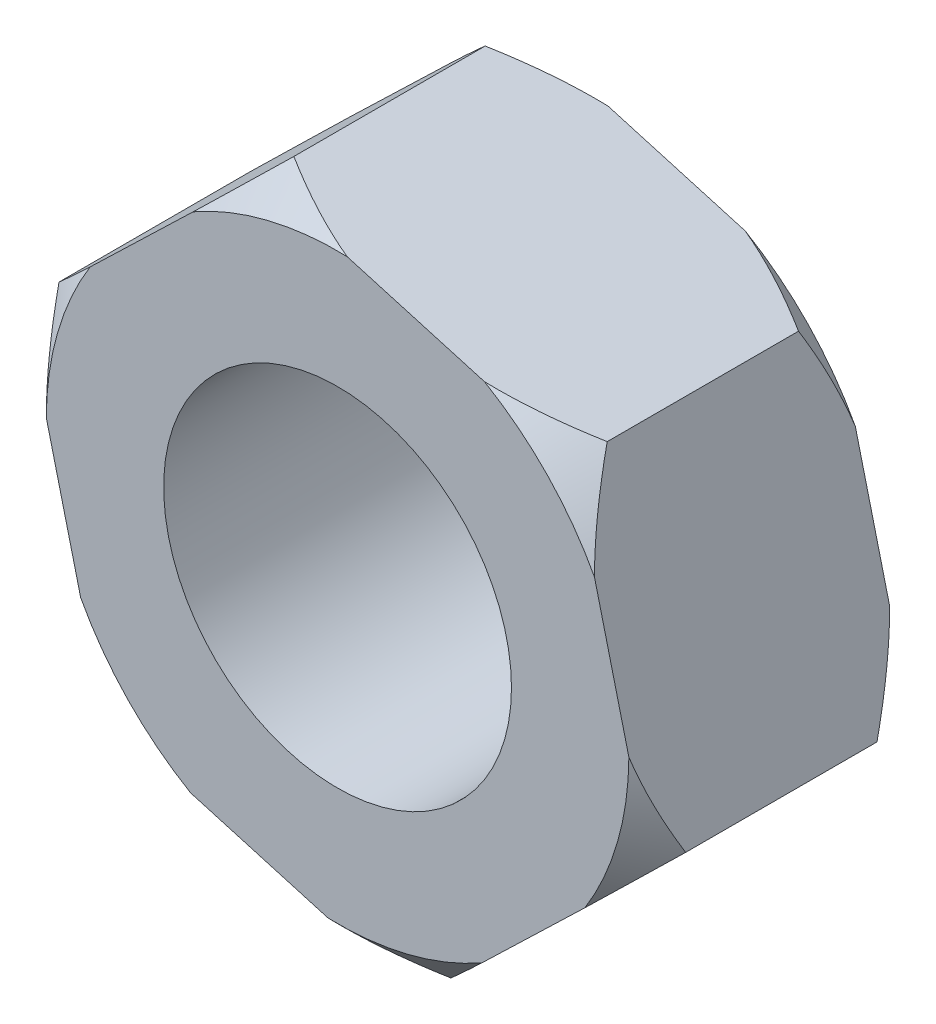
ISO-10303-21;
HEADER;
FILE_DESCRIPTION(('STEP AP214'),'2;1');
FILE_NAME('part.step','',(''),(''),'','','');
FILE_SCHEMA(('AUTOMOTIVE_DESIGN { 1 0 10303 214 1 1 1 1 }'));
ENDSEC;
DATA;
#1=APPLICATION_CONTEXT('core data for automotive mechanical design processes');
#2=APPLICATION_PROTOCOL_DEFINITION('international standard','automotive_design',2000,#1);
#3=PRODUCT_CONTEXT('',#1,'mechanical');
#4=PRODUCT('Part','Part','',(#3));
#5=PRODUCT_RELATED_PRODUCT_CATEGORY('part','',(#4));
#6=PRODUCT_DEFINITION_FORMATION('','',#4);
#7=PRODUCT_DEFINITION_CONTEXT('part definition',#1,'design');
#8=PRODUCT_DEFINITION('design','',#6,#7);
#9=PRODUCT_DEFINITION_SHAPE('','',#8);
#10=(LENGTH_UNIT() NAMED_UNIT(*) SI_UNIT(.MILLI.,.METRE.));
#11=(NAMED_UNIT(*) PLANE_ANGLE_UNIT() SI_UNIT($,.RADIAN.));
#12=(NAMED_UNIT(*) SI_UNIT($,.STERADIAN.) SOLID_ANGLE_UNIT());
#13=UNCERTAINTY_MEASURE_WITH_UNIT(LENGTH_MEASURE(1.E-05),#10,'distance_accuracy_value','');
#14=(GEOMETRIC_REPRESENTATION_CONTEXT(3) GLOBAL_UNCERTAINTY_ASSIGNED_CONTEXT((#13)) GLOBAL_UNIT_ASSIGNED_CONTEXT((#10,
#11,#12)) REPRESENTATION_CONTEXT('',''));
#15=CARTESIAN_POINT('',(0.,0.,0.));
#16=DIRECTION('',(0.,0.,1.));
#17=DIRECTION('',(1.,0.,0.));
#18=AXIS2_PLACEMENT_3D('',#15,#16,#17);
#19=CARTESIAN_POINT('',(-1.88737914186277E-12,1.4432899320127E-12,6.00000000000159));
#20=DIRECTION('',(0.,0.,1.));
#21=DIRECTION('',(1.,0.,0.));
#22=AXIS2_PLACEMENT_3D('',#19,#20,#21);
#23=PLANE('',#22);
#24=CARTESIAN_POINT('',(-1.88737914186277E-12,1.4432899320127E-12,6.00000000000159));
#25=DIRECTION('',(0.,0.,1.));
#26=DIRECTION('',(1.,0.,0.));
#27=AXIS2_PLACEMENT_3D('',#24,#25,#26);
#28=CIRCLE('',#27,4.);
#29=CARTESIAN_POINT('',(3.99999999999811,1.44462219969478E-12,6.00000000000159));
#30=VERTEX_POINT('',#29);
#31=EDGE_CURVE('E215',#30,#30,#28,.T.);
#32=ORIENTED_EDGE('',*,*,#31,.F.);
#33=EDGE_LOOP('',(#32));
#34=FACE_BOUND('',#33,.T.);
#35=CARTESIAN_POINT('',(-1.88737914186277E-12,1.4432899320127E-12,6.00000000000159));
#36=DIRECTION('',(0.,0.,1.));
#37=DIRECTION('',(1.,0.,0.));
#38=AXIS2_PLACEMENT_3D('',#35,#36,#37);
#39=CIRCLE('',#38,6.7);
#40=CARTESIAN_POINT('',(5.68989790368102,-3.53766333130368,6.00000000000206));
#41=VERTEX_POINT('',#40);
#42=CARTESIAN_POINT('',(6.69992138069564,-0.0324575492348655,6.00000000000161));
#43=VERTEX_POINT('',#42);
#44=EDGE_CURVE('E203',#41,#43,#39,.T.);
#45=ORIENTED_EDGE('',*,*,#44,.T.);
#46=DIRECTION('',(-0.240663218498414,0.97060868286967,0.));
#47=VECTOR('',#46,1.);
#48=CARTESIAN_POINT('',(7.20677539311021,-2.07662910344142,6.00000000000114));
#49=LINE('',#48,#47);
#50=CARTESIAN_POINT('',(5.90865526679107,3.15876446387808,6.00000000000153));
#51=VERTEX_POINT('',#50);
#52=EDGE_CURVE('E186',#43,#51,#49,.T.);
#53=ORIENTED_EDGE('',*,*,#52,.T.);
#54=CARTESIAN_POINT('',(3.37806975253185,5.78607334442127,6.00000000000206));
#55=VERTEX_POINT('',#54);
#56=EDGE_CURVE('E192',#51,#55,#39,.T.);
#57=ORIENTED_EDGE('',*,*,#56,.T.);
#58=DIRECTION('',(-0.96090338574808,0.276883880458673,0.));
#59=VECTOR('',#58,1.);
#60=CARTESIAN_POINT('',(5.40180125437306,5.20293601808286,6.00000000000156));
#61=LINE('',#60,#59);
#62=CARTESIAN_POINT('',(0.218757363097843,6.69642779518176,6.00000000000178));
#63=VERTEX_POINT('',#62);
#64=EDGE_CURVE('E174',#55,#63,#61,.T.);
#65=ORIENTED_EDGE('',*,*,#64,.T.);
#66=CARTESIAN_POINT('',(-3.32185162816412,5.81853089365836,6.0000000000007));
#67=VERTEX_POINT('',#66);
#68=EDGE_CURVE('E201',#63,#67,#39,.T.);
#69=ORIENTED_EDGE('',*,*,#68,.T.);
#70=DIRECTION('',(-0.720240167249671,-0.693724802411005,0.));
#71=VECTOR('',#70,1.);
#72=CARTESIAN_POINT('',(-1.80497413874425,7.27956512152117,6.00000000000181));
#73=LINE('',#72,#71);
#74=CARTESIAN_POINT('',(-5.68989790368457,3.53766333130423,6.00000000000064));
#75=VERTEX_POINT('',#74);
#76=EDGE_CURVE('E185',#67,#75,#73,.T.);
#77=ORIENTED_EDGE('',*,*,#76,.T.);
#78=CARTESIAN_POINT('',(-6.6999213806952,0.0324575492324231,6.00000000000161));
#79=VERTEX_POINT('',#78);
#80=EDGE_CURVE('E211',#75,#79,#39,.T.);
#81=ORIENTED_EDGE('',*,*,#80,.T.);
#82=DIRECTION('',(0.240663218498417,-0.970608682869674,0.));
#83=VECTOR('',#82,1.);
#84=CARTESIAN_POINT('',(-7.20677539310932,2.07662910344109,6.00000000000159));
#85=LINE('',#84,#83);
#86=CARTESIAN_POINT('',(-5.90865526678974,-3.15876446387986,6.000000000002));
#87=VERTEX_POINT('',#86);
#88=EDGE_CURVE('E437',#79,#87,#85,.T.);
#89=ORIENTED_EDGE('',*,*,#88,.T.);
#90=CARTESIAN_POINT('',(-3.37806975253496,-5.7860733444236,5.99999999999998));
#91=VERTEX_POINT('',#90);
#92=EDGE_CURVE('E222',#87,#91,#39,.T.);
#93=ORIENTED_EDGE('',*,*,#92,.T.);
#94=DIRECTION('',(0.96090338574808,-0.276883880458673,0.));
#95=VECTOR('',#94,1.);
#96=CARTESIAN_POINT('',(-5.40180125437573,-5.20293601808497,6.00000000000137));
#97=LINE('',#96,#95);
#98=CARTESIAN_POINT('',(-0.218757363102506,-6.69642779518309,6.00000000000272));
#99=VERTEX_POINT('',#98);
#100=EDGE_CURVE('E441',#91,#99,#97,.T.);
#101=ORIENTED_EDGE('',*,*,#100,.T.);
#102=CARTESIAN_POINT('',(3.32185162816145,-5.81853089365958,6.0000000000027));
#103=VERTEX_POINT('',#102);
#104=EDGE_CURVE('E214',#99,#103,#39,.T.);
#105=ORIENTED_EDGE('',*,*,#104,.T.);
#106=DIRECTION('',(0.720240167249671,0.693724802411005,0.));
#107=VECTOR('',#106,1.);
#108=CARTESIAN_POINT('',(1.80497413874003,-7.27956512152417,6.00000000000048));
#109=LINE('',#108,#107);
#110=EDGE_CURVE('E444',#103,#41,#109,.T.);
#111=ORIENTED_EDGE('',*,*,#110,.T.);
#112=EDGE_LOOP('',(#45,#53,#57,#65,#69,#77,#81,#89,#93,#101,#105,#111));
#113=FACE_BOUND('',#112,.T.);
#114=ADVANCED_FACE('F42',(#34,#113),#23,.T.);
#115=CARTESIAN_POINT('',(0.,0.,0.));
#116=DIRECTION('',(0.,0.,1.));
#117=DIRECTION('',(1.,0.,0.));
#118=AXIS2_PLACEMENT_3D('',#115,#116,#117);
#119=PLANE('',#118);
#120=CARTESIAN_POINT('',(0.,0.,0.));
#121=DIRECTION('',(0.,0.,1.));
#122=DIRECTION('',(1.,0.,0.));
#123=AXIS2_PLACEMENT_3D('',#120,#121,#122);
#124=CIRCLE('',#123,4.);
#125=CARTESIAN_POINT('',(4.,0.,0.));
#126=VERTEX_POINT('',#125);
#127=EDGE_CURVE('E224',#126,#126,#124,.T.);
#128=ORIENTED_EDGE('',*,*,#127,.T.);
#129=EDGE_LOOP('',(#128));
#130=FACE_BOUND('',#129,.T.);
#131=DIRECTION('',(-0.240663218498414,0.97060868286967,0.));
#132=VECTOR('',#131,1.);
#133=CARTESIAN_POINT('',(7.20677539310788,-2.07662910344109,1.58206781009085E-12));
#134=LINE('',#133,#132);
#135=CARTESIAN_POINT('',(6.69992138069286,-0.0324575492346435,2.74780198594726E-12));
#136=VERTEX_POINT('',#135);
#137=CARTESIAN_POINT('',(5.9086552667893,3.15876446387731,1.08246744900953E-12));
#138=VERTEX_POINT('',#137);
#139=EDGE_CURVE('E446',#136,#138,#134,.T.);
#140=ORIENTED_EDGE('',*,*,#139,.F.);
#141=CARTESIAN_POINT('',(0.,0.,0.));
#142=DIRECTION('',(0.,0.,1.));
#143=DIRECTION('',(1.,0.,0.));
#144=AXIS2_PLACEMENT_3D('',#141,#142,#143);
#145=CIRCLE('',#144,6.7);
#146=CARTESIAN_POINT('',(5.68989790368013,-3.53766333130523,2.692290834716E-12));
#147=VERTEX_POINT('',#146);
#148=EDGE_CURVE('E210',#136,#147,#145,.F.);
#149=ORIENTED_EDGE('',*,*,#148,.T.);
#150=DIRECTION('',(0.720240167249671,0.693724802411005,0.));
#151=VECTOR('',#150,1.);
#152=CARTESIAN_POINT('',(1.80497413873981,-7.27956512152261,6.66133814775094E-13));
#153=LINE('',#152,#151);
#154=CARTESIAN_POINT('',(3.32185162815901,-5.81853089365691,1.58206781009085E-12));
#155=VERTEX_POINT('',#154);
#156=EDGE_CURVE('E395',#155,#147,#153,.T.);
#157=ORIENTED_EDGE('',*,*,#156,.F.);
#158=CARTESIAN_POINT('',(-0.218757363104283,-6.69642779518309,2.692290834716E-12));
#159=VERTEX_POINT('',#158);
#160=EDGE_CURVE('E381',#155,#159,#145,.F.);
#161=ORIENTED_EDGE('',*,*,#160,.T.);
#162=DIRECTION('',(0.96090338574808,-0.276883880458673,0.));
#163=VECTOR('',#162,1.);
#164=CARTESIAN_POINT('',(-5.40180125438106,-5.20293601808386,6.38378239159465E-13));
#165=LINE('',#164,#163);
#166=CARTESIAN_POINT('',(-3.37806975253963,-5.78607334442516,1.58206781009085E-12));
#167=VERTEX_POINT('',#166);
#168=EDGE_CURVE('E394',#167,#159,#165,.T.);
#169=ORIENTED_EDGE('',*,*,#168,.F.);
#170=CARTESIAN_POINT('',(-5.90865526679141,-3.15876446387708,1.11022302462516E-12));
#171=VERTEX_POINT('',#170);
#172=EDGE_CURVE('E377',#167,#171,#145,.F.);
#173=ORIENTED_EDGE('',*,*,#172,.T.);
#174=DIRECTION('',(0.240663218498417,-0.970608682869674,0.));
#175=VECTOR('',#174,1.);
#176=CARTESIAN_POINT('',(-7.20677539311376,2.07662910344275,9.15933995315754E-13));
#177=LINE('',#176,#175);
#178=CARTESIAN_POINT('',(-6.69992138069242,0.0324575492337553,2.22044604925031E-13));
#179=VERTEX_POINT('',#178);
#180=EDGE_CURVE('E375',#179,#171,#177,.T.);
#181=ORIENTED_EDGE('',*,*,#180,.F.);
#182=CARTESIAN_POINT('',(-5.68989790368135,3.53766333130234,1.58206781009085E-12));
#183=VERTEX_POINT('',#182);
#184=EDGE_CURVE('E364',#179,#183,#145,.F.);
#185=ORIENTED_EDGE('',*,*,#184,.T.);
#186=DIRECTION('',(-0.720240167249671,-0.693724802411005,0.));
#187=VECTOR('',#186,1.);
#188=CARTESIAN_POINT('',(-1.80497413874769,7.27956512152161,8.60422844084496E-13));
#189=LINE('',#188,#187);
#190=CARTESIAN_POINT('',(-3.32185162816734,5.81853089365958,2.27595720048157E-12));
#191=VERTEX_POINT('',#190);
#192=EDGE_CURVE('E373',#191,#183,#189,.T.);
#193=ORIENTED_EDGE('',*,*,#192,.F.);
#194=CARTESIAN_POINT('',(0.218757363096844,6.69642779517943,2.02615701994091E-12));
#195=VERTEX_POINT('',#194);
#196=EDGE_CURVE('E208',#191,#195,#145,.F.);
#197=ORIENTED_EDGE('',*,*,#196,.T.);
#198=DIRECTION('',(-0.96090338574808,0.276883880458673,0.));
#199=VECTOR('',#198,1.);
#200=CARTESIAN_POINT('',(5.40180125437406,5.20293601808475,3.58046925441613E-12));
#201=LINE('',#200,#199);
#202=CARTESIAN_POINT('',(3.37806975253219,5.78607334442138,2.692290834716E-12));
#203=VERTEX_POINT('',#202);
#204=EDGE_CURVE('E449',#203,#195,#201,.T.);
#205=ORIENTED_EDGE('',*,*,#204,.F.);
#206=EDGE_CURVE('E200',#203,#138,#145,.F.);
#207=ORIENTED_EDGE('',*,*,#206,.T.);
#208=EDGE_LOOP('',(#140,#149,#157,#161,#169,#173,#181,#185,#193,#197,#205,#207));
#209=FACE_BOUND('',#208,.T.);
#210=ADVANCED_FACE('F371',(#130,#209),#119,.F.);
#211=CARTESIAN_POINT('',(-1.88737914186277E-12,1.4432899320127E-12,6.00000000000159));
#212=DIRECTION('',(0.,0.,-1.));
#213=DIRECTION('',(-1.,0.,0.));
#214=AXIS2_PLACEMENT_3D('',#211,#212,#213);
#215=CONICAL_SURFACE('',#214,6.7,0.785398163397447);
#216=CARTESIAN_POINT('',(-2.72075345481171,-11.6386797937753,0.747537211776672));
#217=CARTESIAN_POINT('',(-2.6066893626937,-11.528814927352,0.880477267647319));
#218=CARTESIAN_POINT('',(-2.49229917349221,-11.4186359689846,1.01287875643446));
#219=CARTESIAN_POINT('',(-2.26277804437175,-11.1975645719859,1.27644651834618));
#220=CARTESIAN_POINT('',(-2.14764708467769,-11.0866721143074,1.40761275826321));
#221=CARTESIAN_POINT('',(-1.80086761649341,-10.7526591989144,1.79918220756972));
#222=CARTESIAN_POINT('',(-1.56798214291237,-10.5283473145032,2.05748107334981));
#223=CARTESIAN_POINT('',(-1.08722946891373,-10.0652933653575,2.57841328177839));
#224=CARTESIAN_POINT('',(-0.839165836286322,-9.82636209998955,2.84069962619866));
#225=CARTESIAN_POINT('',(-0.462652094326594,-9.46370956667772,3.22571592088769));
#226=CARTESIAN_POINT('',(-0.336425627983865,-9.34213007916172,3.35263863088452));
#227=CARTESIAN_POINT('',(-0.0822694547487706,-9.09733056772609,3.60314779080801));
#228=CARTESIAN_POINT('',(0.0456601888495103,-8.97411060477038,3.72673436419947));
#229=CARTESIAN_POINT('',(0.303963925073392,-8.72531622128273,3.97038601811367));
#230=CARTESIAN_POINT('',(0.434345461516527,-8.59973463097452,4.09043592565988));
#231=CARTESIAN_POINT('',(0.697368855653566,-8.34639434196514,4.32568747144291));
#232=CARTESIAN_POINT('',(0.830010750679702,-8.21863560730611,4.44088902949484));
#233=CARTESIAN_POINT('',(1.09803262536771,-7.96048085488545,4.66551834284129));
#234=CARTESIAN_POINT('',(1.23341566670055,-7.83008188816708,4.77493908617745));
#235=CARTESIAN_POINT('',(1.50710773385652,-7.56646568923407,4.98651412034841));
#236=CARTESIAN_POINT('',(1.64541668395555,-7.43324852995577,5.08866859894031));
#237=CARTESIAN_POINT('',(1.92255071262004,-7.16631708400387,5.28210332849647));
#238=CARTESIAN_POINT('',(2.06131231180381,-7.03266393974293,5.37355773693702));
#239=CARTESIAN_POINT('',(2.34224862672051,-6.76207018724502,5.54590226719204));
#240=CARTESIAN_POINT('',(2.48442377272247,-6.62512916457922,5.62679104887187));
#241=CARTESIAN_POINT('',(2.7719272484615,-6.34821001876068,5.77546787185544));
#242=CARTESIAN_POINT('',(2.91724704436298,-6.20824011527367,5.84328737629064));
#243=CARTESIAN_POINT('',(3.21112866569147,-5.92517763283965,5.96344903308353));
#244=CARTESIAN_POINT('',(3.35968870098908,-5.78208677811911,6.01579951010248));
#245=CARTESIAN_POINT('',(3.65945283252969,-5.49335834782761,6.1024833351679));
#246=CARTESIAN_POINT('',(3.81065511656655,-5.34772251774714,6.13682856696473));
#247=CARTESIAN_POINT('',(4.11474073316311,-5.05483169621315,6.1855174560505));
#248=CARTESIAN_POINT('',(4.26762394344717,-4.90757682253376,6.19986255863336));
#249=CARTESIAN_POINT('',(4.57353919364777,-4.61292372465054,6.20759741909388));
#250=CARTESIAN_POINT('',(4.72657098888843,-4.46552573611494,6.20100537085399));
#251=CARTESIAN_POINT('',(5.03145753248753,-4.17186347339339,6.16735570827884));
#252=CARTESIAN_POINT('',(5.18331209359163,-4.02559937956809,6.14029490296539));
#253=CARTESIAN_POINT('',(5.51665565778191,-3.70452773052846,6.05961928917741));
#254=CARTESIAN_POINT('',(5.69758620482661,-3.53025807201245,6.00158432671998));
#255=CARTESIAN_POINT('',(6.05470780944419,-3.18628376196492,5.86222903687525));
#256=CARTESIAN_POINT('',(6.2308965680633,-3.01658132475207,5.78089762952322));
#257=CARTESIAN_POINT('',(6.58058411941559,-2.67976738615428,5.59831725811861));
#258=CARTESIAN_POINT('',(6.75401051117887,-2.51272562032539,5.49680490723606));
#259=CARTESIAN_POINT('',(7.09580971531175,-2.18350962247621,5.27882687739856));
#260=CARTESIAN_POINT('',(7.26418351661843,-2.02133443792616,5.16236414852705));
#261=CARTESIAN_POINT('',(7.63194898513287,-1.66710811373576,4.89170474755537));
#262=CARTESIAN_POINT('',(7.83028457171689,-1.47607417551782,4.73476155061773));
#263=CARTESIAN_POINT('',(8.22149208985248,-1.0992688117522,4.4081807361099));
#264=CARTESIAN_POINT('',(8.41436202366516,-0.913499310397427,4.23853855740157));
#265=CARTESIAN_POINT('',(8.79594728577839,-0.545961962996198,3.88938068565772));
#266=CARTESIAN_POINT('',(8.98465332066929,-0.364203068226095,3.70984552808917));
#267=CARTESIAN_POINT('',(9.35830515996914,-0.00430707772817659,3.34349467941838));
#268=CARTESIAN_POINT('',(9.54325148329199,0.173830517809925,3.15668000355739));
#269=CARTESIAN_POINT('',(9.8985479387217,0.516046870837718,2.78928756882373));
#270=CARTESIAN_POINT('',(10.0690846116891,0.680305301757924,2.60905629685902));
#271=CARTESIAN_POINT('',(10.4079198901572,1.00666648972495,2.24456720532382));
#272=CARTESIAN_POINT('',(10.5762183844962,1.16876913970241,2.06030918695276));
#273=CARTESIAN_POINT('',(10.9100896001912,1.49034901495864,1.6894635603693));
#274=CARTESIAN_POINT('',(11.0756717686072,1.64983533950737,1.50289230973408));
#275=CARTESIAN_POINT('',(11.4052226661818,1.96725394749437,1.12708464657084));
#276=CARTESIAN_POINT('',(11.5691916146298,2.12518644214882,0.937848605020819));
#277=CARTESIAN_POINT('',(11.7325029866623,2.28248556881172,0.747537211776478));
#278=B_SPLINE_CURVE_WITH_KNOTS('',3,(#216,#217,#218,#219,#220,#221,#222,#223,#224,#225,#226,
#227,#228,#229,#230,#231,#232,#233,#234,#235,#236,#237,#238,#239,#240,#241,#242,#243,#244,#245,
#246,#247,#248,#249,#250,#251,#252,#253,#254,#255,#256,#257,#258,#259,#260,#261,#262,#263,#264,
#265,#266,#267,#268,#269,#270,#271,#272,#273,#274,#275,#276,#277),.UNSPECIFIED.,.F.,.F.,(4,2,2,
2,2,2,2,2,2,2,2,2,2,2,2,2,2,2,2,2,2,2,2,2,2,2,2,2,2,2,4),(0.,0.620309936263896,1.24063650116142,
2.48210455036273,3.78066886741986,4.42980450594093,5.0789160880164,5.73049527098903,
6.38208522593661,7.03444820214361,7.68679431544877,8.3263291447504,8.96594501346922,
9.60400128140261,10.2417135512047,10.8790043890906,11.5162491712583,12.1529403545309,
12.7897308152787,13.5618135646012,14.3342641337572,15.1175501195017,15.9006817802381,
16.8510798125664,17.8018208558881,18.7545043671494,19.7070554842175,20.5997091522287,
21.4924069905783,22.3806192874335,23.2687091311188),.UNSPECIFIED.);
#279=CARTESIAN_POINT('',(7.20677539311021,-2.07662910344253,5.20000000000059));
#280=VERTEX_POINT('',#279);
#281=EDGE_CURVE('E242',#41,#280,#278,.T.);
#282=ORIENTED_EDGE('',*,*,#281,.T.);
#283=CARTESIAN_POINT('',(8.32893325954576,-6.60235669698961,2.07163026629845));
#284=CARTESIAN_POINT('',(8.28449672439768,-6.42314158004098,2.21775744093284));
#285=CARTESIAN_POINT('',(8.23985370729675,-6.24309370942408,2.36281361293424));
#286=CARTESIAN_POINT('',(8.15007614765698,-5.88101561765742,2.65033210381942));
#287=CARTESIAN_POINT('',(8.10494153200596,-5.69898510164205,2.79279402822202));
#288=CARTESIAN_POINT('',(8.01391271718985,-5.33186062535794,3.0752572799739));
#289=CARTESIAN_POINT('',(7.96801602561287,-5.14675661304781,3.21524477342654));
#290=CARTESIAN_POINT('',(7.87557346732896,-4.77393042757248,3.49145804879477));
#291=CARTESIAN_POINT('',(7.82902763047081,-4.58620837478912,3.62768400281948));
#292=CARTESIAN_POINT('',(7.73302038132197,-4.19900558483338,3.90174580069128));
#293=CARTESIAN_POINT('',(7.68352338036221,-3.99938131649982,4.03936715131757));
#294=CARTESIAN_POINT('',(7.58355815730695,-3.59621578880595,4.30845193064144));
#295=CARTESIAN_POINT('',(7.53308984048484,-3.3926741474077,4.43991475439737));
#296=CARTESIAN_POINT('',(7.43111688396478,-2.98141131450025,4.69489393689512));
#297=CARTESIAN_POINT('',(7.37961419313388,-2.7736979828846,4.81842368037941));
#298=CARTESIAN_POINT('',(7.27533153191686,-2.35311997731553,5.05573667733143));
#299=CARTESIAN_POINT('',(7.22255190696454,-2.14025669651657,5.16952252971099));
#300=CARTESIAN_POINT('',(7.12054277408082,-1.72884796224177,5.37470411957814));
#301=CARTESIAN_POINT('',(7.07144216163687,-1.53082235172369,5.46719848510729));
#302=CARTESIAN_POINT('',(6.97196014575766,-1.12960562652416,5.63962043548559));
#303=CARTESIAN_POINT('',(6.92157862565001,-0.926414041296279,5.71954687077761));
#304=CARTESIAN_POINT('',(6.82006423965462,-0.517000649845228,5.86321065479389));
#305=CARTESIAN_POINT('',(6.76894463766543,-0.310832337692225,5.9271077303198));
#306=CARTESIAN_POINT('',(6.66558084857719,0.106039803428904,6.03680597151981));
#307=CARTESIAN_POINT('',(6.61333677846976,0.316743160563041,6.08260901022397));
#308=CARTESIAN_POINT('',(6.50696863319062,0.745732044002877,6.15413715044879));
#309=CARTESIAN_POINT('',(6.45282785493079,0.964084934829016,6.17944243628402));
#310=CARTESIAN_POINT('',(6.34420719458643,1.40215834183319,6.20659531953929));
#311=CARTESIAN_POINT('',(6.28972736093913,1.62187866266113,6.20844619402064));
#312=CARTESIAN_POINT('',(6.18091744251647,2.06071535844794,6.18853568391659));
#313=CARTESIAN_POINT('',(6.12658785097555,2.27982974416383,6.16672863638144));
#314=CARTESIAN_POINT('',(6.01871105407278,2.71490310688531,6.10103462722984));
#315=CARTESIAN_POINT('',(5.96516406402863,2.93086121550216,6.05714170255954));
#316=CARTESIAN_POINT('',(5.84623604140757,3.41050481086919,5.93691375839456));
#317=CARTESIAN_POINT('',(5.78116911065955,3.6729235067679,5.85526564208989));
#318=CARTESIAN_POINT('',(5.65306713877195,4.18956617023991,5.66811725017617));
#319=CARTESIAN_POINT('',(5.59003316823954,4.44378581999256,5.56260463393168));
#320=CARTESIAN_POINT('',(5.46542193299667,4.94635014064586,5.33230189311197));
#321=CARTESIAN_POINT('',(5.40386168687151,5.19462617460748,5.20735496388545));
#322=CARTESIAN_POINT('',(5.28255623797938,5.68385806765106,4.94335169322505));
#323=CARTESIAN_POINT('',(5.22281068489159,5.92481533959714,4.80429809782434));
#324=CARTESIAN_POINT('',(5.08503989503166,6.48045290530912,4.46690896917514));
#325=CARTESIAN_POINT('',(5.00761702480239,6.79270381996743,4.26435221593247));
#326=CARTESIAN_POINT('',(4.85491607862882,7.40855556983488,3.84561228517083));
#327=CARTESIAN_POINT('',(4.77963888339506,7.71215285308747,3.62942362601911));
#328=CARTESIAN_POINT('',(4.66903381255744,8.15822950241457,3.30076473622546));
#329=CARTESIAN_POINT('',(4.63305048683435,8.30335233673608,3.19206954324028));
#330=CARTESIAN_POINT('',(4.56144492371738,8.59214171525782,2.97263828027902));
#331=CARTESIAN_POINT('',(4.52582269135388,8.73580823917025,2.86190218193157));
#332=CARTESIAN_POINT('',(4.45494119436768,9.02167741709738,2.63879087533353));
#333=CARTESIAN_POINT('',(4.41968156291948,9.16388155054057,2.52641767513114));
#334=CARTESIAN_POINT('',(4.34945312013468,9.44711692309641,2.30012886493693));
#335=CARTESIAN_POINT('',(4.31448429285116,9.58814822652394,2.18621334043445));
#336=CARTESIAN_POINT('',(4.2796433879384,9.72866361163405,2.07163026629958));
#337=B_SPLINE_CURVE_WITH_KNOTS('',3,(#283,#284,#285,#286,#287,#288,#289,#290,#291,#292,#293,
#294,#295,#296,#297,#298,#299,#300,#301,#302,#303,#304,#305,#306,#307,#308,#309,#310,#311,#312,
#313,#314,#315,#316,#317,#318,#319,#320,#321,#322,#323,#324,#325,#326,#327,#328,#329,#330,#331,
#332,#333,#334,#335,#336),.UNSPECIFIED.,.F.,.F.,(4,2,2,2,2,2,2,2,2,2,2,2,2,2,2,2,2,2,2,2,2,2,2,
2,2,2,4),(0.,0.706416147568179,1.41293883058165,2.12261749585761,2.83226363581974,
3.5745725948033,4.31695431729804,5.05804866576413,5.79894472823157,6.47063520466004,
7.14238708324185,7.80715250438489,8.47184909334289,9.1498376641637,9.82773150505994,
10.5069361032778,11.1863241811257,12.032128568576,12.8783713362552,13.7318347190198,
14.5851322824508,15.7251107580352,16.8655505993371,17.4200918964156,17.9746409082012,
18.5285590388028,19.0824465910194),.UNSPECIFIED.);
#338=EDGE_CURVE('E232',#280,#43,#337,.T.);
#339=ORIENTED_EDGE('',*,*,#338,.T.);
#340=ORIENTED_EDGE('',*,*,#44,.F.);
#341=EDGE_LOOP('',(#282,#339,#340));
#342=FACE_BOUND('',#341,.T.);
#343=ADVANCED_FACE('F248',(#342),#215,.T.);
#344=CARTESIAN_POINT('',(-9.92752884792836,-3.89884963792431,2.03431401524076));
#345=CARTESIAN_POINT('',(-9.75024367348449,-3.94993428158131,2.1806317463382));
#346=CARTESIAN_POINT('',(-9.57214353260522,-4.00125375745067,2.32589273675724));
#347=CARTESIAN_POINT('',(-9.21400504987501,-4.1044512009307,2.6138572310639));
#348=CARTESIAN_POINT('',(-9.03396643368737,-4.15632924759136,2.75656036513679));
#349=CARTESIAN_POINT('',(-8.67091909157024,-4.26094117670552,3.03952643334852));
#350=CARTESIAN_POINT('',(-8.48790095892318,-4.31367776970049,3.17977632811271));
#351=CARTESIAN_POINT('',(-8.11930528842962,-4.41988844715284,3.45657588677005));
#352=CARTESIAN_POINT('',(-7.93372785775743,-4.473362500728,3.59312570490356));
#353=CARTESIAN_POINT('',(-7.55179396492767,-4.58341658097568,3.86734815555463));
#354=CARTESIAN_POINT('',(-7.35531070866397,-4.64003314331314,4.00483018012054));
#355=CARTESIAN_POINT('',(-6.95858327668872,-4.75434997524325,4.273779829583));
#356=CARTESIAN_POINT('',(-6.75833936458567,-4.81205016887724,4.40524787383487));
#357=CARTESIAN_POINT('',(-6.35378303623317,-4.92862289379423,4.66047939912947));
#358=CARTESIAN_POINT('',(-6.14947763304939,-4.98749340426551,4.78425485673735));
#359=CARTESIAN_POINT('',(-5.73586525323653,-5.10667562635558,5.02236116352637));
#360=CARTESIAN_POINT('',(-5.52655938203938,-5.16698701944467,5.13669407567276));
#361=CARTESIAN_POINT('',(-5.12088777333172,-5.28388111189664,5.34390621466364));
#362=CARTESIAN_POINT('',(-4.92499797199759,-5.3403266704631,5.43778761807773));
#363=CARTESIAN_POINT('',(-4.52810036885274,-5.4546925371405,5.61322259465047));
#364=CARTESIAN_POINT('',(-4.32709188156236,-5.51261304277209,5.69477450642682));
#365=CARTESIAN_POINT('',(-3.92171514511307,-5.62942216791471,5.84204539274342));
#366=CARTESIAN_POINT('',(-3.71739213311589,-5.68829775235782,5.9078976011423));
#367=CARTESIAN_POINT('',(-3.30420344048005,-5.80735788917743,6.0216568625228));
#368=CARTESIAN_POINT('',(-3.09533997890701,-5.86754180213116,6.06957248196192));
#369=CARTESIAN_POINT('',(-2.70389543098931,-5.98033637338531,6.13942974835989));
#370=CARTESIAN_POINT('',(-2.52176356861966,-6.03281758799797,6.1640821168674));
#371=CARTESIAN_POINT('',(-2.1561331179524,-6.13817383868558,6.19690911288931));
#372=CARTESIAN_POINT('',(-1.97263472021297,-6.19104881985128,6.20508599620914));
#373=CARTESIAN_POINT('',(-1.60566352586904,-6.29679140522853,6.20451863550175));
#374=CARTESIAN_POINT('',(-1.42219072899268,-6.34965900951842,6.19577458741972));
#375=CARTESIAN_POINT('',(-1.05665690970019,-6.45498741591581,6.16184619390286));
#376=CARTESIAN_POINT('',(-0.874596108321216,-6.50744815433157,6.13665932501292));
#377=CARTESIAN_POINT('',(-0.456769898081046,-6.62784458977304,6.06087307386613));
#378=CARTESIAN_POINT('',(-0.221919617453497,-6.69551659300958,6.00480516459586));
#379=CARTESIAN_POINT('',(0.241839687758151,-6.8291486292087,5.87051494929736));
#380=CARTESIAN_POINT('',(0.470745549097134,-6.89510775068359,5.79228110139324));
#381=CARTESIAN_POINT('',(0.924464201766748,-7.02584657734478,5.61702292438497));
#382=CARTESIAN_POINT('',(1.1492086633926,-7.09060659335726,5.51980969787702));
#383=CARTESIAN_POINT('',(1.59233048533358,-7.21829194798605,5.31102373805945));
#384=CARTESIAN_POINT('',(1.81070888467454,-7.28121758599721,5.1994533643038));
#385=CARTESIAN_POINT('',(2.22263191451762,-7.39991302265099,4.9754639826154));
#386=CARTESIAN_POINT('',(2.41666033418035,-7.45582222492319,4.86399928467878));
#387=CARTESIAN_POINT('',(2.8005677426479,-7.56644497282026,4.63354868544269));
#388=CARTESIAN_POINT('',(2.99044608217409,-7.62115833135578,4.51456161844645));
#389=CARTESIAN_POINT('',(3.36675224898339,-7.72959078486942,4.27040094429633));
#390=CARTESIAN_POINT('',(3.55317626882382,-7.78330878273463,4.14522101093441));
#391=CARTESIAN_POINT('',(3.92286914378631,-7.88983561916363,3.88990897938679));
#392=CARTESIAN_POINT('',(4.1061378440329,-7.94264441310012,3.7597766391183));
#393=CARTESIAN_POINT('',(4.46274961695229,-8.04540193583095,3.50066909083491));
#394=CARTESIAN_POINT('',(4.63619869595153,-8.09538121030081,3.37185143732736));
#395=CARTESIAN_POINT('',(4.98090615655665,-8.19470851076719,3.11107350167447));
#396=CARTESIAN_POINT('',(5.15216446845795,-8.24405651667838,2.97911311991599));
#397=CARTESIAN_POINT('',(5.49226270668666,-8.34205567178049,2.71294565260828));
#398=CARTESIAN_POINT('',(5.66110829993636,-8.39070845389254,2.57874639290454));
#399=CARTESIAN_POINT('',(5.99710972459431,-8.48752711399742,2.30811432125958));
#400=CARTESIAN_POINT('',(6.16426574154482,-8.53569304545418,2.17168175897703));
#401=CARTESIAN_POINT('',(6.330701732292,-8.58365150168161,2.0343140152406));
#402=B_SPLINE_CURVE_WITH_KNOTS('',3,(#344,#345,#346,#347,#348,#349,#350,#351,#352,#353,#354,
#355,#356,#357,#358,#359,#360,#361,#362,#363,#364,#365,#366,#367,#368,#369,#370,#371,#372,#373,
#374,#375,#376,#377,#378,#379,#380,#381,#382,#383,#384,#385,#386,#387,#388,#389,#390,#391,#392,
#393,#394,#395,#396,#397,#398,#399,#400,#401),.UNSPECIFIED.,.F.,.F.,(4,2,2,2,2,2,2,2,2,2,2,2,2,
2,2,2,2,2,2,2,2,2,2,2,2,2,2,2,4),(0.,0.706433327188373,1.41296797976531,2.12252297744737,
2.83204835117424,3.57115984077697,4.31021971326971,5.04809852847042,5.7858157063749,
6.45880550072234,7.13188589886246,7.79903293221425,8.46586093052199,9.03861255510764,
9.61128575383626,10.1839523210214,10.7567067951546,11.5076663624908,12.2590176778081,
13.0182679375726,13.7773935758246,14.469139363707,15.1609926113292,15.8535678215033,
16.5461769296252,17.2114111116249,17.8766664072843,18.5399482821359,19.2031565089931),.UNSPECIFIED.);
#403=CARTESIAN_POINT('',(1.80497413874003,-7.27956512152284,5.20000000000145));
#404=VERTEX_POINT('',#403);
#405=EDGE_CURVE('E322',#99,#404,#402,.T.);
#406=ORIENTED_EDGE('',*,*,#405,.T.);
#407=EDGE_CURVE('E241',#404,#103,#278,.T.);
#408=ORIENTED_EDGE('',*,*,#407,.T.);
#409=ORIENTED_EDGE('',*,*,#104,.F.);
#410=EDGE_LOOP('',(#406,#408,#409));
#411=FACE_BOUND('',#410,.T.);
#412=ADVANCED_FACE('F484',(#411),#215,.T.);
#413=CARTESIAN_POINT('',(-8.32893325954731,6.60235669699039,2.07163026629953));
#414=CARTESIAN_POINT('',(-8.28449672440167,6.42314158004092,2.21775744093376));
#415=CARTESIAN_POINT('',(-8.23985370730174,6.24309370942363,2.36281361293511));
#416=CARTESIAN_POINT('',(-8.15007614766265,5.88101561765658,2.65033210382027));
#417=CARTESIAN_POINT('',(-8.10494153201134,5.69898510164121,2.7927940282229));
#418=CARTESIAN_POINT('',(-8.013912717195,5.33186062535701,3.07525727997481));
#419=CARTESIAN_POINT('',(-7.96801602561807,5.14675661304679,3.21524477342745));
#420=CARTESIAN_POINT('',(-7.87557346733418,4.7739304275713,3.49145804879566));
#421=CARTESIAN_POINT('',(-7.82902763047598,4.58620837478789,3.62768400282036));
#422=CARTESIAN_POINT('',(-7.73302038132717,4.19900558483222,3.90174580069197));
#423=CARTESIAN_POINT('',(-7.68352338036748,3.9993813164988,4.03936715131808));
#424=CARTESIAN_POINT('',(-7.58355815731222,3.59621578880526,4.30845193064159));
#425=CARTESIAN_POINT('',(-7.53308984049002,3.39267414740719,4.43991475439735));
#426=CARTESIAN_POINT('',(-7.43111688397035,2.98141131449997,4.69489393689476));
#427=CARTESIAN_POINT('',(-7.37961419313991,2.77369798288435,4.8184236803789));
#428=CARTESIAN_POINT('',(-7.27533153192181,2.35311997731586,5.05573667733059));
#429=CARTESIAN_POINT('',(-7.22255190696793,2.14025669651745,5.16952252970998));
#430=CARTESIAN_POINT('',(-7.12054277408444,1.72884796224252,5.37470411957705));
#431=CARTESIAN_POINT('',(-7.07144216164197,1.53082235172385,5.46719848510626));
#432=CARTESIAN_POINT('',(-6.97196014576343,1.12960562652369,5.63962043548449));
#433=CARTESIAN_POINT('',(-6.92157862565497,0.926414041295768,5.71954687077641));
#434=CARTESIAN_POINT('',(-6.82006423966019,0.517000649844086,5.86321065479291));
#435=CARTESIAN_POINT('',(-6.7689446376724,0.310832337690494,5.92710773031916));
#436=CARTESIAN_POINT('',(-6.66558084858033,-0.106039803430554,6.03680597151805));
#437=CARTESIAN_POINT('',(-6.61333677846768,-0.316743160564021,6.08260901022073));
#438=CARTESIAN_POINT('',(-6.50696863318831,-0.74573204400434,6.15413715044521));
#439=CARTESIAN_POINT('',(-6.45282785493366,-0.96408493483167,6.17944243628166));
#440=CARTESIAN_POINT('',(-6.34420719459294,-1.40215834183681,6.20659531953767));
#441=CARTESIAN_POINT('',(-6.28972736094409,-1.62187866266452,6.20844619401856));
#442=CARTESIAN_POINT('',(-6.18091744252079,-2.06071535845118,6.18853568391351));
#443=CARTESIAN_POINT('',(-6.12658785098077,-2.27982974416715,6.16672863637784));
#444=CARTESIAN_POINT('',(-6.01871105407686,-2.71490310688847,6.10103462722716));
#445=CARTESIAN_POINT('',(-5.96516406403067,-2.93086121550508,6.05714170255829));
#446=CARTESIAN_POINT('',(-5.84623604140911,-3.41050481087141,5.93691375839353));
#447=CARTESIAN_POINT('',(-5.78116911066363,-3.6729235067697,5.85526564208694));
#448=CARTESIAN_POINT('',(-5.65306713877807,-4.18956617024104,5.66811725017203));
#449=CARTESIAN_POINT('',(-5.59003316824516,-4.44378581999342,5.56260463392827));
#450=CARTESIAN_POINT('',(-5.46542193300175,-4.94635014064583,5.33230189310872));
#451=CARTESIAN_POINT('',(-5.40386168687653,-5.19462617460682,5.20735496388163));
#452=CARTESIAN_POINT('',(-5.28255623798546,-5.6838580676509,4.94335169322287));
#453=CARTESIAN_POINT('',(-5.22281068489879,-5.92481533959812,4.80429809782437));
#454=CARTESIAN_POINT('',(-5.08503989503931,-6.48045290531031,4.4669089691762));
#455=CARTESIAN_POINT('',(-5.00761702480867,-6.79270381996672,4.26435221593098));
#456=CARTESIAN_POINT('',(-4.85491607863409,-7.40855556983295,3.84561228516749));
#457=CARTESIAN_POINT('',(-4.77963888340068,-7.71215285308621,3.62942362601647));
#458=CARTESIAN_POINT('',(-4.66903381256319,-8.1582295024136,3.30076473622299));
#459=CARTESIAN_POINT('',(-4.63305048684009,-8.30335233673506,3.19206954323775));
#460=CARTESIAN_POINT('',(-4.56144492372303,-8.59214171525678,2.97263828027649));
#461=CARTESIAN_POINT('',(-4.52582269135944,-8.73580823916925,2.8619021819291));
#462=CARTESIAN_POINT('',(-4.45494119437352,-9.0216774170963,2.63879087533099));
#463=CARTESIAN_POINT('',(-4.41968156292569,-9.16388155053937,2.52641767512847));
#464=CARTESIAN_POINT('',(-4.34945312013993,-9.44711692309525,2.30012886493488));
#465=CARTESIAN_POINT('',(-4.31448429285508,-9.58814822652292,2.18621334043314));
#466=CARTESIAN_POINT('',(-4.27964338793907,-9.72866361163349,2.0716302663));
#467=B_SPLINE_CURVE_WITH_KNOTS('',3,(#413,#414,#415,#416,#417,#418,#419,#420,#421,#422,#423,
#424,#425,#426,#427,#428,#429,#430,#431,#432,#433,#434,#435,#436,#437,#438,#439,#440,#441,#442,
#443,#444,#445,#446,#447,#448,#449,#450,#451,#452,#453,#454,#455,#456,#457,#458,#459,#460,#461,
#462,#463,#464,#465,#466),.UNSPECIFIED.,.F.,.F.,(4,2,2,2,2,2,2,2,2,2,2,2,2,2,2,2,2,2,2,2,2,2,2,
2,2,2,4),(0.,0.706416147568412,1.41293883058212,2.12261749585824,2.83226363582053,
3.57457259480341,4.31695431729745,5.05804866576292,5.79894472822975,6.47063520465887,
7.14238708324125,7.80715250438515,8.47184909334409,9.14983766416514,9.8277315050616,
10.5069361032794,11.1863241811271,12.0321285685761,12.8783713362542,13.731834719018,
14.5851322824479,15.7251107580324,16.8655505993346,17.4200918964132,17.9746409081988,
18.5285590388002,19.0824465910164),.UNSPECIFIED.);
#468=CARTESIAN_POINT('',(-5.40180125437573,-5.20293601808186,5.20000000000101));
#469=VERTEX_POINT('',#468);
#470=EDGE_CURVE('E314',#87,#469,#467,.T.);
#471=ORIENTED_EDGE('',*,*,#470,.T.);
#472=EDGE_CURVE('E329',#469,#91,#402,.T.);
#473=ORIENTED_EDGE('',*,*,#472,.T.);
#474=ORIENTED_EDGE('',*,*,#92,.F.);
#475=EDGE_LOOP('',(#471,#473,#474));
#476=FACE_BOUND('',#475,.T.);
#477=ADVANCED_FACE('F473',(#476),#215,.T.);
#478=CARTESIAN_POINT('',(2.72075345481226,11.6386797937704,0.747537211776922));
#479=CARTESIAN_POINT('',(2.6066893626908,11.5288149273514,0.880477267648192));
#480=CARTESIAN_POINT('',(2.49229917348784,11.4186359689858,1.0128787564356));
#481=CARTESIAN_POINT('',(2.26277804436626,11.1975645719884,1.27644651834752));
#482=CARTESIAN_POINT('',(2.14764708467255,11.0866721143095,1.40761275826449));
#483=CARTESIAN_POINT('',(1.80086761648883,10.7526591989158,1.7991822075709));
#484=CARTESIAN_POINT('',(1.5679821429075,10.528347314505,2.05748107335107));
#485=CARTESIAN_POINT('',(1.08722946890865,10.0652933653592,2.57841328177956));
#486=CARTESIAN_POINT('',(0.839165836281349,9.82636209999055,2.84069962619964));
#487=CARTESIAN_POINT('',(0.462652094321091,9.46370956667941,3.22571592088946));
#488=CARTESIAN_POINT('',(0.336425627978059,9.34213007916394,3.35263863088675));
#489=CARTESIAN_POINT('',(0.0822694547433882,9.09733056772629,3.6031477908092));
#490=CARTESIAN_POINT('',(-0.0456601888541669,8.97411060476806,3.72673436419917));
#491=CARTESIAN_POINT('',(-0.303963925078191,8.72531622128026,3.97038601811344));
#492=CARTESIAN_POINT('',(-0.4343454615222,8.59973463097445,4.09043592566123));
#493=CARTESIAN_POINT('',(-0.697368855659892,8.34639434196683,4.32568747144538));
#494=CARTESIAN_POINT('',(-0.830010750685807,8.21863560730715,4.44088902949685));
#495=CARTESIAN_POINT('',(-1.09803262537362,7.96048085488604,4.66551834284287));
#496=CARTESIAN_POINT('',(-1.23341566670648,7.83008188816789,4.77493908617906));
#497=CARTESIAN_POINT('',(-1.50710773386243,7.56646568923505,4.98651412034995));
#498=CARTESIAN_POINT('',(-1.64541668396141,7.43324852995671,5.08866859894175));
#499=CARTESIAN_POINT('',(-1.9225507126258,7.16631708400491,5.28210332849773));
#500=CARTESIAN_POINT('',(-2.06131231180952,7.0326639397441,5.3735577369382));
#501=CARTESIAN_POINT('',(-2.34224862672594,6.76207018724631,5.54590226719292));
#502=CARTESIAN_POINT('',(-2.48442377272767,6.62512916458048,5.62679104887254));
#503=CARTESIAN_POINT('',(-2.77192724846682,6.34821001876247,5.77546787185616));
#504=CARTESIAN_POINT('',(-2.91724704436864,6.20824011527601,5.84328737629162));
#505=CARTESIAN_POINT('',(-3.21112866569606,5.92517763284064,5.96344903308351));
#506=CARTESIAN_POINT('',(-3.35968870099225,5.78208677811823,6.01579951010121));
#507=CARTESIAN_POINT('',(-3.65945283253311,5.49335834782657,6.10248333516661));
#508=CARTESIAN_POINT('',(-3.81065511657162,5.3477225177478,6.13682856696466));
#509=CARTESIAN_POINT('',(-4.11474073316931,5.05483169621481,6.18551745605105));
#510=CARTESIAN_POINT('',(-4.26762394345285,4.90757682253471,6.19986255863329));
#511=CARTESIAN_POINT('',(-4.5735391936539,4.61292372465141,6.20759741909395));
#512=CARTESIAN_POINT('',(-4.72657098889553,4.46552573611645,6.20100537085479));
#513=CARTESIAN_POINT('',(-5.03145753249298,4.17186347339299,6.1673557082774));
#514=CARTESIAN_POINT('',(-5.18331209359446,4.02559937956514,6.14029490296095));
#515=CARTESIAN_POINT('',(-5.51665565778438,3.70452773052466,6.05961928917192));
#516=CARTESIAN_POINT('',(-5.69758620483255,3.53025807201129,6.00158432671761));
#517=CARTESIAN_POINT('',(-6.05470780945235,3.18628376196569,5.86222903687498));
#518=CARTESIAN_POINT('',(-6.23089656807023,3.01658132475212,5.78089762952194));
#519=CARTESIAN_POINT('',(-6.58058411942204,2.67976738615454,5.59831725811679));
#520=CARTESIAN_POINT('',(-6.75401051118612,2.51272562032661,5.49680490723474));
#521=CARTESIAN_POINT('',(-7.09580971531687,2.18350962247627,5.27882687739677));
#522=CARTESIAN_POINT('',(-7.26418351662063,2.0213344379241,5.16236414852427));
#523=CARTESIAN_POINT('',(-7.63194898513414,1.66710811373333,4.89170474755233));
#524=CARTESIAN_POINT('',(-7.83028457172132,1.47607417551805,4.73476155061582));
#525=CARTESIAN_POINT('',(-8.22149208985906,1.09926881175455,4.40818073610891));
#526=CARTESIAN_POINT('',(-8.41436202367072,0.91349931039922,4.23853855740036));
#527=CARTESIAN_POINT('',(-8.79594728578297,0.545961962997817,3.88938068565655));
#528=CARTESIAN_POINT('',(-8.98465332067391,0.364203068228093,3.70984552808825));
#529=CARTESIAN_POINT('',(-9.35830515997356,0.00430707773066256,3.34349467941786));
#530=CARTESIAN_POINT('',(-9.54325148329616,-0.17383051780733,3.15668000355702));
#531=CARTESIAN_POINT('',(-9.8985479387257,-0.516046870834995,2.78928756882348));
#532=CARTESIAN_POINT('',(-10.0690846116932,-0.680305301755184,2.60905629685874));
#533=CARTESIAN_POINT('',(-10.4079198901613,-1.00666648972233,2.24456720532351));
#534=CARTESIAN_POINT('',(-10.5762183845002,-1.16876913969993,2.06030918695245));
#535=CARTESIAN_POINT('',(-10.9100896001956,-1.49034901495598,1.68946356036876));
#536=CARTESIAN_POINT('',(-11.0756717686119,-1.64983533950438,1.5028923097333));
#537=CARTESIAN_POINT('',(-11.405222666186,-1.96725394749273,1.12708464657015));
#538=CARTESIAN_POINT('',(-11.5691916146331,-2.12518644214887,0.937848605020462));
#539=CARTESIAN_POINT('',(-11.7325029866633,-2.28248556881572,0.747537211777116));
#540=B_SPLINE_CURVE_WITH_KNOTS('',3,(#478,#479,#480,#481,#482,#483,#484,#485,#486,#487,#488,
#489,#490,#491,#492,#493,#494,#495,#496,#497,#498,#499,#500,#501,#502,#503,#504,#505,#506,#507,
#508,#509,#510,#511,#512,#513,#514,#515,#516,#517,#518,#519,#520,#521,#522,#523,#524,#525,#526,
#527,#528,#529,#530,#531,#532,#533,#534,#535,#536,#537,#538,#539),.UNSPECIFIED.,.F.,.F.,(4,2,2,
2,2,2,2,2,2,2,2,2,2,2,2,2,2,2,2,2,2,2,2,2,2,2,2,2,2,2,4),(0.,0.620309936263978,1.24063650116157,
2.48210455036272,3.78066886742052,4.42980450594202,5.07891608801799,5.73049527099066,
6.38208522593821,7.03444820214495,7.68679431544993,8.3263291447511,8.96594501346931,
9.60400128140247,10.2417135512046,10.879004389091,11.5162491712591,12.1529403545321,
12.7897308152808,13.5618135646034,14.334264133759,15.1175501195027,15.9006817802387,
16.8510798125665,17.8018208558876,18.754504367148,19.7070554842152,20.5997091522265,
21.4924069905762,22.380619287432,23.2687091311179),.UNSPECIFIED.);
#541=CARTESIAN_POINT('',(-7.20677539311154,2.07662910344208,5.20000000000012));
#542=VERTEX_POINT('',#541);
#543=EDGE_CURVE('E195',#75,#542,#540,.T.);
#544=ORIENTED_EDGE('',*,*,#543,.T.);
#545=EDGE_CURVE('E321',#542,#79,#467,.T.);
#546=ORIENTED_EDGE('',*,*,#545,.T.);
#547=ORIENTED_EDGE('',*,*,#80,.F.);
#548=EDGE_LOOP('',(#544,#546,#547));
#549=FACE_BOUND('',#548,.T.);
#550=ADVANCED_FACE('F462',(#549),#215,.T.);
#551=ORIENTED_EDGE('',*,*,#56,.F.);
#552=CARTESIAN_POINT('',(5.40180125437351,5.20293601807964,5.2000000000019));
#553=VERTEX_POINT('',#552);
#554=EDGE_CURVE('E193',#51,#553,#337,.T.);
#555=ORIENTED_EDGE('',*,*,#554,.T.);
#556=CARTESIAN_POINT('',(9.92752884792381,3.89884963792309,2.03431401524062));
#557=CARTESIAN_POINT('',(9.75024367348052,3.94993428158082,2.18063174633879));
#558=CARTESIAN_POINT('',(9.57214353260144,4.00125375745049,2.32589273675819));
#559=CARTESIAN_POINT('',(9.21400504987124,4.10445120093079,2.61385723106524));
#560=CARTESIAN_POINT('',(9.03396643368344,4.1563292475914,2.75656036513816));
#561=CARTESIAN_POINT('',(8.67091909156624,4.26094117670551,3.03952643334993));
#562=CARTESIAN_POINT('',(8.48790095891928,4.31367776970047,3.17977632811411));
#563=CARTESIAN_POINT('',(8.11930528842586,4.4198884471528,3.45657588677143));
#564=CARTESIAN_POINT('',(7.93372785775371,4.47336250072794,3.59312570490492));
#565=CARTESIAN_POINT('',(7.55179396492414,4.58341658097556,3.86734815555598));
#566=CARTESIAN_POINT('',(7.35531070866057,4.64003314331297,4.00483018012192));
#567=CARTESIAN_POINT('',(6.95858327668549,4.75434997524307,4.2737798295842));
#568=CARTESIAN_POINT('',(6.75833936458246,4.8120501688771,4.40524787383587));
#569=CARTESIAN_POINT('',(6.35378303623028,4.92862289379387,4.66047939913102));
#570=CARTESIAN_POINT('',(6.1494776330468,4.98749340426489,4.78425485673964));
#571=CARTESIAN_POINT('',(5.73586525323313,5.10667562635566,5.02236116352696));
#572=CARTESIAN_POINT('',(5.52655938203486,5.16698701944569,5.13669407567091));
#573=CARTESIAN_POINT('',(5.12088777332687,5.28388111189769,5.34390621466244));
#574=CARTESIAN_POINT('',(4.92499797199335,5.34032667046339,5.43778761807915));
#575=CARTESIAN_POINT('',(4.52810036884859,5.45469253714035,5.61322259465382));
#576=CARTESIAN_POINT('',(4.32709188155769,5.51261304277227,5.69477450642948));
#577=CARTESIAN_POINT('',(3.92171514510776,5.62942216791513,5.84204539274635));
#578=CARTESIAN_POINT('',(3.71739213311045,5.68829775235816,5.90789760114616));
#579=CARTESIAN_POINT('',(3.30420344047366,5.80735788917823,6.02165686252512));
#580=CARTESIAN_POINT('',(3.0953399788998,5.8675418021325,6.06957248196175));
#581=CARTESIAN_POINT('',(2.70389543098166,5.98033637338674,6.13942974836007));
#582=CARTESIAN_POINT('',(2.52176356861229,6.03281758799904,6.16408211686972));
#583=CARTESIAN_POINT('',(2.15613311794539,6.13817383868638,6.19690911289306));
#584=CARTESIAN_POINT('',(1.97263472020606,6.19104881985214,6.20508599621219));
#585=CARTESIAN_POINT('',(1.60566352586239,6.29679140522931,6.20451863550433));
#586=CARTESIAN_POINT('',(1.42219072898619,6.34965900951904,6.19577458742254));
#587=CARTESIAN_POINT('',(1.05665690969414,6.45498741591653,6.16184619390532));
#588=CARTESIAN_POINT('',(0.87459610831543,6.50744815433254,6.13665932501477));
#589=CARTESIAN_POINT('',(0.45676989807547,6.62784458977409,6.06087307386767));
#590=CARTESIAN_POINT('',(0.221919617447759,6.69551659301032,6.00480516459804));
#591=CARTESIAN_POINT('',(-0.241839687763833,6.82914862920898,5.87051494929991));
#592=CARTESIAN_POINT('',(-0.4707455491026,6.89510775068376,5.79228110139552));
#593=CARTESIAN_POINT('',(-0.924464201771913,7.02584657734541,5.61702292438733));
#594=CARTESIAN_POINT('',(-1.14920866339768,7.09060659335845,5.51980969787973));
#595=CARTESIAN_POINT('',(-1.59233048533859,7.21829194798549,5.31102373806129));
#596=CARTESIAN_POINT('',(-1.81070888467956,7.28121758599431,5.19945336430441));
#597=CARTESIAN_POINT('',(-2.22263191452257,7.39991302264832,4.97546398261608));
#598=CARTESIAN_POINT('',(-2.41666033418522,7.45582222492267,4.86399928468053));
#599=CARTESIAN_POINT('',(-2.80056774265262,7.56644497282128,4.63354868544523));
#600=CARTESIAN_POINT('',(-2.99044608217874,7.6211583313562,4.51456161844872));
#601=CARTESIAN_POINT('',(-3.36675224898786,7.72959078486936,4.27040094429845));
#602=CARTESIAN_POINT('',(-3.55317626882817,7.7833087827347,4.14522101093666));
#603=CARTESIAN_POINT('',(-3.92286914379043,7.88983561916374,3.88990897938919));
#604=CARTESIAN_POINT('',(-4.10613784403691,7.94264441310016,3.75977663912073));
#605=CARTESIAN_POINT('',(-4.46274961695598,8.04540193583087,3.50066909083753));
#606=CARTESIAN_POINT('',(-4.63619869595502,8.09538121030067,3.37185143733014));
#607=CARTESIAN_POINT('',(-4.98090615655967,8.19470851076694,3.1110735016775));
#608=CARTESIAN_POINT('',(-5.1521644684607,8.24405651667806,2.97911311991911));
#609=CARTESIAN_POINT('',(-5.4922627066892,8.34205567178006,2.71294565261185));
#610=CARTESIAN_POINT('',(-5.66110829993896,8.39070845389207,2.57874639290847));
#611=CARTESIAN_POINT('',(-5.99710972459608,8.48752711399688,2.30811432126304));
#612=CARTESIAN_POINT('',(-6.1642657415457,8.53569304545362,2.17168175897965));
#613=CARTESIAN_POINT('',(-6.33070173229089,8.58365150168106,2.03431401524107));
#614=B_SPLINE_CURVE_WITH_KNOTS('',3,(#556,#557,#558,#559,#560,#561,#562,#563,#564,#565,#566,
#567,#568,#569,#570,#571,#572,#573,#574,#575,#576,#577,#578,#579,#580,#581,#582,#583,#584,#585,
#586,#587,#588,#589,#590,#591,#592,#593,#594,#595,#596,#597,#598,#599,#600,#601,#602,#603,#604,
#605,#606,#607,#608,#609,#610,#611,#612,#613),.UNSPECIFIED.,.F.,.F.,(4,2,2,2,2,2,2,2,2,2,2,2,2,
2,2,2,2,2,2,2,2,2,2,2,2,2,2,2,4),(0.,0.70643332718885,1.41296797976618,2.12252297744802,
2.83204835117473,3.57115984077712,4.31021971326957,5.04809852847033,5.78581570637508,
6.45880550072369,7.13188589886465,7.79903293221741,8.46586093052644,9.03861255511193,
9.61128575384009,10.1839523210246,10.7567067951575,11.5076663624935,12.2590176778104,
13.0182679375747,13.7773935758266,14.4691393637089,15.1609926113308,15.8535678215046,
16.5461769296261,17.211411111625,17.8766664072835,18.5399482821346,19.2031565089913),.UNSPECIFIED.);
#615=EDGE_CURVE('E177',#553,#55,#614,.T.);
#616=ORIENTED_EDGE('',*,*,#615,.T.);
#617=EDGE_LOOP('',(#551,#555,#616));
#618=FACE_BOUND('',#617,.T.);
#619=ADVANCED_FACE('F191',(#618),#215,.T.);
#620=CARTESIAN_POINT('',(-1.80497413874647,7.27956512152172,5.20000000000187));
#621=VERTEX_POINT('',#620);
#622=EDGE_CURVE('E179',#63,#621,#614,.T.);
#623=ORIENTED_EDGE('',*,*,#622,.T.);
#624=EDGE_CURVE('E308',#621,#67,#540,.T.);
#625=ORIENTED_EDGE('',*,*,#624,.T.);
#626=ORIENTED_EDGE('',*,*,#68,.F.);
#627=EDGE_LOOP('',(#623,#625,#626));
#628=FACE_BOUND('',#627,.T.);
#629=ADVANCED_FACE('F490',(#628),#215,.T.);
#630=CARTESIAN_POINT('',(0.,8.88178419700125E-13,0.800000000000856));
#631=DIRECTION('',(0.,0.,1.));
#632=DIRECTION('',(1.,0.,0.));
#633=AXIS2_PLACEMENT_3D('',#630,#631,#632);
#634=CONICAL_SURFACE('',#633,7.5,0.78539816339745);
#635=ORIENTED_EDGE('',*,*,#148,.F.);
#636=CARTESIAN_POINT('',(4.27964338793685,9.72866361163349,3.92836973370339));
#637=CARTESIAN_POINT('',(4.32407992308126,9.54944849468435,3.78224255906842));
#638=CARTESIAN_POINT('',(4.36872294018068,9.36940062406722,3.63718638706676));
#639=CARTESIAN_POINT('',(4.45850049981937,9.00732253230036,3.34966789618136));
#640=CARTESIAN_POINT('',(4.50363511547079,8.82529201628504,3.2072059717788));
#641=CARTESIAN_POINT('',(4.59466393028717,8.45816754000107,2.92474272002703));
#642=CARTESIAN_POINT('',(4.64056062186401,8.27306352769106,2.78475522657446));
#643=CARTESIAN_POINT('',(4.73300318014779,7.90023734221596,2.50854195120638));
#644=CARTESIAN_POINT('',(4.77954901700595,7.71251528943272,2.37231599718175));
#645=CARTESIAN_POINT('',(4.87555626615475,7.32531249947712,2.09825419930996));
#646=CARTESIAN_POINT('',(4.92505326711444,7.12568823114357,1.96063284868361));
#647=CARTESIAN_POINT('',(5.02501849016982,6.72252270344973,1.69154806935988));
#648=CARTESIAN_POINT('',(5.07548680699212,6.51898106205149,1.56008524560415));
#649=CARTESIAN_POINT('',(5.17745976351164,6.1077182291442,1.30510606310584));
#650=CARTESIAN_POINT('',(5.22896245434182,5.90000489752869,1.18157631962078));
#651=CARTESIAN_POINT('',(5.33324511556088,5.47942689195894,0.94426332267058));
#652=CARTESIAN_POINT('',(5.38602474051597,5.26656361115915,0.830477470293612));
#653=CARTESIAN_POINT('',(5.48803387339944,4.85515487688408,0.625295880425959));
#654=CARTESIAN_POINT('',(5.53713448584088,4.65712926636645,0.532801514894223));
#655=CARTESIAN_POINT('',(5.63661650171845,4.25591254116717,0.360379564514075));
#656=CARTESIAN_POINT('',(5.68699802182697,4.0527209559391,0.280453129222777));
#657=CARTESIAN_POINT('',(5.78851240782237,3.64330756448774,0.136789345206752));
#658=CARTESIAN_POINT('',(5.83963200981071,3.43713925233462,0.0728922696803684));
#659=CARTESIAN_POINT('',(5.94299579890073,3.02026711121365,-0.0368059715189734));
#660=CARTESIAN_POINT('',(5.99523986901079,2.80956375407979,-0.0826090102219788));
#661=CARTESIAN_POINT('',(6.10160801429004,2.38057487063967,-0.154137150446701));
#662=CARTESIAN_POINT('',(6.15574879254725,2.16222197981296,-0.179442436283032));
#663=CARTESIAN_POINT('',(6.26436945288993,1.72414857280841,-0.206595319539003));
#664=CARTESIAN_POINT('',(6.31884928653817,1.50442825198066,-0.208446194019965));
#665=CARTESIAN_POINT('',(6.42765920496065,1.06559155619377,-0.188535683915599));
#666=CARTESIAN_POINT('',(6.48198879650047,0.846477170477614,-0.166728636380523));
#667=CARTESIAN_POINT('',(6.58986559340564,0.41140380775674,-0.101034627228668));
#668=CARTESIAN_POINT('',(6.64341258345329,0.195445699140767,-0.0571417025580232));
#669=CARTESIAN_POINT('',(6.76234060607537,-0.284197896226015,0.0630862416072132));
#670=CARTESIAN_POINT('',(6.82740753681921,-0.546616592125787,0.144734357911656));
#671=CARTESIAN_POINT('',(6.95550950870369,-1.06325925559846,0.331882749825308));
#672=CARTESIAN_POINT('',(7.01854347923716,-1.31747890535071,0.437395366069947));
#673=CARTESIAN_POINT('',(7.14315471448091,-1.82004322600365,0.66769810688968));
#674=CARTESIAN_POINT('',(7.20471496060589,-2.06831925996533,0.792645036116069));
#675=CARTESIAN_POINT('',(7.3260204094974,-2.55755115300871,1.05664830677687));
#676=CARTESIAN_POINT('',(7.38576596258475,-2.79850842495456,1.19570190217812));
#677=CARTESIAN_POINT('',(7.52353675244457,-3.35414599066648,1.53309103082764));
#678=CARTESIAN_POINT('',(7.60095962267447,-3.66639690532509,1.73564778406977));
#679=CARTESIAN_POINT('',(7.75366056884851,-4.2822486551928,2.15438771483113));
#680=CARTESIAN_POINT('',(7.82893776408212,-4.58584593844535,2.37057637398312));
#681=CARTESIAN_POINT('',(7.93954283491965,-5.03192258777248,2.69923526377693));
#682=CARTESIAN_POINT('',(7.97552616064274,-5.177045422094,2.80793045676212));
#683=CARTESIAN_POINT('',(8.04713172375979,-5.46583480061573,3.02736171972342));
#684=CARTESIAN_POINT('',(8.08275395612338,-5.60950132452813,3.13809781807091));
#685=CARTESIAN_POINT('',(8.15363545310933,-5.89537050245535,3.361209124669));
#686=CARTESIAN_POINT('',(8.1888950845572,-6.03757463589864,3.47358232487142));
#687=CARTESIAN_POINT('',(8.25912352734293,-6.32081000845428,3.69987113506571));
#688=CARTESIAN_POINT('',(8.29409235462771,-6.4618413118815,3.81378665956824));
#689=CARTESIAN_POINT('',(8.32893325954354,-6.60235669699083,3.9283697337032));
#690=B_SPLINE_CURVE_WITH_KNOTS('',3,(#636,#637,#638,#639,#640,#641,#642,#643,#644,#645,#646,
#647,#648,#649,#650,#651,#652,#653,#654,#655,#656,#657,#658,#659,#660,#661,#662,#663,#664,#665,
#666,#667,#668,#669,#670,#671,#672,#673,#674,#675,#676,#677,#678,#679,#680,#681,#682,#683,#684,
#685,#686,#687,#688,#689),.UNSPECIFIED.,.F.,.F.,(4,2,2,2,2,2,2,2,2,2,2,2,2,2,2,2,2,2,2,2,2,2,2,
2,2,2,4),(0.,0.706416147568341,1.41293883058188,2.12261749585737,2.83226363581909,
3.57457259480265,4.31695431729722,5.0580486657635,5.79894472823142,6.47063520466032,
7.14238708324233,7.80715250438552,8.47184909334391,9.14983766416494,9.82773150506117,
10.506936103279,11.1863241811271,12.0321285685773,12.8783713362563,13.7318347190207,
14.5851322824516,15.7251107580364,16.8655505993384,17.420091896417,17.9746409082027,
18.5285590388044,19.0824465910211),.UNSPECIFIED.);
#691=CARTESIAN_POINT('',(7.20677539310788,-2.07662910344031,0.800000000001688));
#692=VERTEX_POINT('',#691);
#693=EDGE_CURVE('E11',#136,#692,#690,.T.);
#694=ORIENTED_EDGE('',*,*,#693,.T.);
#695=CARTESIAN_POINT('',(11.7325029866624,2.28248556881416,5.25246278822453));
#696=CARTESIAN_POINT('',(11.6184388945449,2.17262070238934,5.11952273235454));
#697=CARTESIAN_POINT('',(11.5040487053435,2.06244174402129,4.98712124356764));
#698=CARTESIAN_POINT('',(11.2745275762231,1.84137034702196,4.72355348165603));
#699=CARTESIAN_POINT('',(11.159396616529,1.73047788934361,4.59238724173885));
#700=CARTESIAN_POINT('',(10.8126171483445,1.39646497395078,4.20081779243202));
#701=CARTESIAN_POINT('',(10.5797316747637,1.17215308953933,3.9425189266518));
#702=CARTESIAN_POINT('',(10.0989790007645,0.709099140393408,3.42158671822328));
#703=CARTESIAN_POINT('',(9.85091536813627,0.470167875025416,3.15930037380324));
#704=CARTESIAN_POINT('',(9.47440162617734,0.107515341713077,2.77428407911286));
#705=CARTESIAN_POINT('',(9.34817515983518,-0.0140641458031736,2.64736136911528));
#706=CARTESIAN_POINT('',(9.09401898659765,-0.258863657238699,2.39685220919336));
#707=CARTESIAN_POINT('',(8.96608934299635,-0.382083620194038,2.27326563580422));
#708=CARTESIAN_POINT('',(8.70778560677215,-0.630878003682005,2.02961398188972));
#709=CARTESIAN_POINT('',(8.57740407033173,-0.756459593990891,1.90956407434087));
#710=CARTESIAN_POINT('',(8.31438067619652,-1.00979988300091,1.67431252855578));
#711=CARTESIAN_POINT('',(8.18173878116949,-1.13755861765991,1.55911097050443));
#712=CARTESIAN_POINT('',(7.91371690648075,-1.39571337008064,1.33448165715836));
#713=CARTESIAN_POINT('',(7.77833386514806,-1.5261123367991,1.22506091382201));
#714=CARTESIAN_POINT('',(7.50464179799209,-1.78972853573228,1.01348587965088));
#715=CARTESIAN_POINT('',(7.3663328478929,-1.92294569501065,0.911331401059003));
#716=CARTESIAN_POINT('',(7.08919881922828,-2.1898771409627,0.717896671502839));
#717=CARTESIAN_POINT('',(6.95043722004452,-2.32353028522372,0.626442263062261));
#718=CARTESIAN_POINT('',(6.66950090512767,-2.59412403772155,0.454097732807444));
#719=CARTESIAN_POINT('',(6.52732575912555,-2.73106506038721,0.373208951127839));
#720=CARTESIAN_POINT('',(6.2398222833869,-3.00798420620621,0.224532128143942));
#721=CARTESIAN_POINT('',(6.09450248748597,-3.14795410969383,0.156712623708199));
#722=CARTESIAN_POINT('',(5.80062086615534,-3.4310165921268,0.0365509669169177));
#723=CARTESIAN_POINT('',(5.65206083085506,-3.57410744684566,-0.0157995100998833));
#724=CARTESIAN_POINT('',(5.35229669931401,-3.86283587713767,-0.102483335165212));
#725=CARTESIAN_POINT('',(5.20109441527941,-4.00847170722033,-0.136828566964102));
#726=CARTESIAN_POINT('',(4.89700879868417,-4.30136252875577,-0.185517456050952));
#727=CARTESIAN_POINT('',(4.74412558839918,-4.44861740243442,-0.199862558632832));
#728=CARTESIAN_POINT('',(4.43821033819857,-4.74327050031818,-0.207597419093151));
#729=CARTESIAN_POINT('',(4.28517854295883,-4.89066848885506,-0.201005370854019));
#730=CARTESIAN_POINT('',(3.98029199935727,-5.18433075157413,-0.167355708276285));
#731=CARTESIAN_POINT('',(3.82843743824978,-5.33059484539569,-0.140294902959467));
#732=CARTESIAN_POINT('',(3.49509387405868,-5.65166649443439,-0.0596192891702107));
#733=CARTESIAN_POINT('',(3.31416332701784,-5.8259361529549,-0.00158432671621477));
#734=CARTESIAN_POINT('',(2.95704172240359,-6.16991046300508,0.137770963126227));
#735=CARTESIAN_POINT('',(2.78085296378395,-6.33961290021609,0.219102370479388));
#736=CARTESIAN_POINT('',(2.43116541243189,-6.67642683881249,0.401682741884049));
#737=CARTESIAN_POINT('',(2.2577390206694,-6.84346860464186,0.503195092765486));
#738=CARTESIAN_POINT('',(1.91593981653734,-7.17268460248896,0.721173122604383));
#739=CARTESIAN_POINT('',(1.74756601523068,-7.33485978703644,0.837635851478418));
#740=CARTESIAN_POINT('',(1.37980054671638,-7.68908611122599,1.10829525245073));
#741=CARTESIAN_POINT('',(1.18146496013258,-7.88012004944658,1.2652384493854));
#742=CARTESIAN_POINT('',(0.79025744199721,-8.25692541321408,1.59181926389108));
#743=CARTESIAN_POINT('',(0.597387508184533,-8.44269491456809,1.76146144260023));
#744=CARTESIAN_POINT('',(0.215802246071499,-8.81023226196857,2.11061931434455));
#745=CARTESIAN_POINT('',(0.027096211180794,-8.99199115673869,2.29015447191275));
#746=CARTESIAN_POINT('',(-0.346555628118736,-9.35188714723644,2.65650532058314));
#747=CARTESIAN_POINT('',(-0.531501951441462,-9.53002474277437,2.84331999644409));
#748=CARTESIAN_POINT('',(-0.886798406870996,-9.87224109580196,3.21071243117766));
#749=CARTESIAN_POINT('',(-1.05733507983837,-10.0364995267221,3.39094370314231));
#750=CARTESIAN_POINT('',(-1.39617035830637,-10.3628607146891,3.75543279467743));
#751=CARTESIAN_POINT('',(-1.56446885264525,-10.5249633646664,3.93969081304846));
#752=CARTESIAN_POINT('',(-1.89834006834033,-10.8465432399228,4.31053643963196));
#753=CARTESIAN_POINT('',(-2.06392223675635,-11.0060295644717,4.49710769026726));
#754=CARTESIAN_POINT('',(-2.39347313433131,-11.3234481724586,4.87291535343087));
#755=CARTESIAN_POINT('',(-2.55744208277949,-11.4813806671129,5.06215139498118));
#756=CARTESIAN_POINT('',(-2.72075345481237,-11.6386797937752,5.25246278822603));
#757=B_SPLINE_CURVE_WITH_KNOTS('',3,(#695,#696,#697,#698,#699,#700,#701,#702,#703,#704,#705,
#706,#707,#708,#709,#710,#711,#712,#713,#714,#715,#716,#717,#718,#719,#720,#721,#722,#723,#724,
#725,#726,#727,#728,#729,#730,#731,#732,#733,#734,#735,#736,#737,#738,#739,#740,#741,#742,#743,
#744,#745,#746,#747,#748,#749,#750,#751,#752,#753,#754,#755,#756),.UNSPECIFIED.,.F.,.F.,(4,2,2,
2,2,2,2,2,2,2,2,2,2,2,2,2,2,2,2,2,2,2,2,2,2,2,2,2,2,2,4),(0.,0.620309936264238,1.24063650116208,
2.48210455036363,3.78066886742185,4.4298045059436,5.07891608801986,5.73049527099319,
6.38208522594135,7.03444820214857,7.68679431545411,8.32632914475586,8.96594501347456,
9.60400128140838,10.2417135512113,10.8790043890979,11.5162491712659,12.1529403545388,
12.7897308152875,13.561813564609,14.3342641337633,15.1175501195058,15.9006817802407,
16.8510798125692,17.8018208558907,18.7545043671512,19.7070554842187,20.5997091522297,
21.492406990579,22.3806192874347,23.2687091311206),.UNSPECIFIED.);
#758=EDGE_CURVE('E58',#692,#147,#757,.T.);
#759=ORIENTED_EDGE('',*,*,#758,.T.);
#760=EDGE_LOOP('',(#635,#694,#759));
#761=FACE_BOUND('',#760,.T.);
#762=ADVANCED_FACE('F44',(#761),#634,.T.);
#763=ORIENTED_EDGE('',*,*,#160,.F.);
#764=CARTESIAN_POINT('',(1.80497413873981,-7.27956512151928,0.800000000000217));
#765=VERTEX_POINT('',#764);
#766=EDGE_CURVE('E47',#155,#765,#757,.T.);
#767=ORIENTED_EDGE('',*,*,#766,.T.);
#768=CARTESIAN_POINT('',(6.33070173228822,-8.58365150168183,3.96568598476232));
#769=CARTESIAN_POINT('',(6.15341655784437,-8.53256685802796,3.81936825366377));
#770=CARTESIAN_POINT('',(5.97531641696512,-8.48124738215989,3.67410726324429));
#771=CARTESIAN_POINT('',(5.61717793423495,-8.37804993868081,3.38614276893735));
#772=CARTESIAN_POINT('',(5.43713931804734,-8.32617189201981,3.24343963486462));
#773=CARTESIAN_POINT('',(5.07409197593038,-8.22155996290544,2.96047356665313));
#774=CARTESIAN_POINT('',(4.89107384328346,-8.16882336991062,2.82022367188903));
#775=CARTESIAN_POINT('',(4.52247817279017,-8.0626126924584,2.54342411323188));
#776=CARTESIAN_POINT('',(4.3369007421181,-8.00913863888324,2.4068742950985));
#777=CARTESIAN_POINT('',(3.95496684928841,-7.89908455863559,2.13265184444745));
#778=CARTESIAN_POINT('',(3.75848359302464,-7.84246799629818,1.99516981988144));
#779=CARTESIAN_POINT('',(3.3617561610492,-7.72815116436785,1.72622017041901));
#780=CARTESIAN_POINT('',(3.16151224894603,-7.67045097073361,1.59475212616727));
#781=CARTESIAN_POINT('',(2.75695592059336,-7.55387824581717,1.33952060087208));
#782=CARTESIAN_POINT('',(2.55265051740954,-7.4950077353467,1.21574514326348));
#783=CARTESIAN_POINT('',(2.13903813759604,-7.37582551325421,0.977638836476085));
#784=CARTESIAN_POINT('',(1.92973226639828,-7.31551412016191,0.86330592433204));
#785=CARTESIAN_POINT('',(1.52406065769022,-7.19862002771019,0.656093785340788));
#786=CARTESIAN_POINT('',(1.32817085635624,-7.14217446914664,0.562212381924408));
#787=CARTESIAN_POINT('',(0.931273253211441,-7.0278086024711,0.386777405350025));
#788=CARTESIAN_POINT('',(0.730264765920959,-6.96988809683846,0.305225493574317));
#789=CARTESIAN_POINT('',(0.324888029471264,-6.85307897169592,0.157954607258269));
#790=CARTESIAN_POINT('',(0.120565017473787,-6.79420338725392,0.09210239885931));
#791=CARTESIAN_POINT('',(-0.292623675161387,-6.67514325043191,-0.0216568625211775));
#792=CARTESIAN_POINT('',(-0.501487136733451,-6.61495933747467,-0.0695724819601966));
#793=CARTESIAN_POINT('',(-0.892931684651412,-6.50216476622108,-0.13942974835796));
#794=CARTESIAN_POINT('',(-1.07506354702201,-6.4496835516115,-0.164082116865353));
#795=CARTESIAN_POINT('',(-1.44069399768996,-6.34432730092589,-0.19690911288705));
#796=CARTESIAN_POINT('',(-1.62419239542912,-6.29145231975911,-0.205085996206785));
#797=CARTESIAN_POINT('',(-1.9911635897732,-6.18570973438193,-0.204518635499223));
#798=CARTESIAN_POINT('',(-2.17463638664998,-6.13284213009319,-0.19577458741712));
#799=CARTESIAN_POINT('',(-2.54017020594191,-6.02751372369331,-0.161846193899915));
#800=CARTESIAN_POINT('',(-2.7222310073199,-5.97505298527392,-0.136659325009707));
#801=CARTESIAN_POINT('',(-3.14005721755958,-5.85465654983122,-0.0608730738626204));
#802=CARTESIAN_POINT('',(-3.37490749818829,-5.78698454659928,-0.00480516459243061));
#803=CARTESIAN_POINT('',(-3.83866680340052,-5.65335251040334,0.129485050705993));
#804=CARTESIAN_POINT('',(-4.06757266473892,-5.587393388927,0.207718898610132));
#805=CARTESIAN_POINT('',(-4.52129131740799,-5.45665456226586,0.382977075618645));
#806=CARTESIAN_POINT('',(-4.74603577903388,-5.39189454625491,0.480190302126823));
#807=CARTESIAN_POINT('',(-5.18915760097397,-5.2642091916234,0.688976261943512));
#808=CARTESIAN_POINT('',(-5.407536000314,-5.201283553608,0.800546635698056));
#809=CARTESIAN_POINT('',(-5.81945903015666,-5.08258811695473,1.02453601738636));
#810=CARTESIAN_POINT('',(-6.01348744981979,-5.02667891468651,1.13600071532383));
#811=CARTESIAN_POINT('',(-6.39739485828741,-4.91605616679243,1.36645131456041));
#812=CARTESIAN_POINT('',(-6.58727319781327,-4.86134280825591,1.4854383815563));
#813=CARTESIAN_POINT('',(-6.96357936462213,-4.7529103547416,1.72959905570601));
#814=CARTESIAN_POINT('',(-7.15000338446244,-4.69919235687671,1.85477898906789));
#815=CARTESIAN_POINT('',(-7.51969625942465,-4.592665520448,2.11009102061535));
#816=CARTESIAN_POINT('',(-7.70296495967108,-4.53985672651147,2.24022336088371));
#817=CARTESIAN_POINT('',(-8.05957673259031,-4.43709920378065,2.49933090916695));
#818=CARTESIAN_POINT('',(-8.23302581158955,-4.38711992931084,2.62814856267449));
#819=CARTESIAN_POINT('',(-8.57773327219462,-4.28779262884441,2.88892649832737));
#820=CARTESIAN_POINT('',(-8.74899158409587,-4.23844462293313,3.02088688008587));
#821=CARTESIAN_POINT('',(-9.08908982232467,-4.14044546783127,3.28705434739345));
#822=CARTESIAN_POINT('',(-9.25793541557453,-4.09179268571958,3.42125360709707));
#823=CARTESIAN_POINT('',(-9.59393684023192,-3.99497402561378,3.69188567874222));
#824=CARTESIAN_POINT('',(-9.76109285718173,-3.94680809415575,3.82831824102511));
#825=CARTESIAN_POINT('',(-9.92752884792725,-3.89884963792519,3.96568598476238));
#826=B_SPLINE_CURVE_WITH_KNOTS('',3,(#768,#769,#770,#771,#772,#773,#774,#775,#776,#777,#778,
#779,#780,#781,#782,#783,#784,#785,#786,#787,#788,#789,#790,#791,#792,#793,#794,#795,#796,#797,
#798,#799,#800,#801,#802,#803,#804,#805,#806,#807,#808,#809,#810,#811,#812,#813,#814,#815,#816,
#817,#818,#819,#820,#821,#822,#823,#824,#825),.UNSPECIFIED.,.F.,.F.,(4,2,2,2,2,2,2,2,2,2,2,2,2,
2,2,2,2,2,2,2,2,2,2,2,2,2,2,2,4),(0.,0.706433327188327,1.41296797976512,2.12252297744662,
2.83204835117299,3.571159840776,4.31021971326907,5.04809852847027,5.78581570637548,
6.45880550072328,7.13188589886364,7.79903293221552,8.46586093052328,9.03861255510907,
9.6112857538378,10.1839523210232,10.7567067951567,11.5076663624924,12.2590176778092,
13.018267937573,13.7773935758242,14.469139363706,15.1609926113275,15.8535678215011,
16.5461769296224,17.211411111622,17.8766664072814,18.5399482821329,19.2031565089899),.UNSPECIFIED.);
#827=EDGE_CURVE('E343',#765,#159,#826,.T.);
#828=ORIENTED_EDGE('',*,*,#827,.T.);
#829=EDGE_LOOP('',(#763,#767,#828));
#830=FACE_BOUND('',#829,.T.);
#831=ADVANCED_FACE('F398',(#830),#634,.T.);
#832=ORIENTED_EDGE('',*,*,#172,.F.);
#833=CARTESIAN_POINT('',(-5.40180125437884,-5.20293601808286,0.800000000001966));
#834=VERTEX_POINT('',#833);
#835=EDGE_CURVE('E336',#167,#834,#826,.T.);
#836=ORIENTED_EDGE('',*,*,#835,.T.);
#837=CARTESIAN_POINT('',(-4.27964338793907,-9.72866361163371,3.92836973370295));
#838=CARTESIAN_POINT('',(-4.32407992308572,-9.54944849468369,3.78224255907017));
#839=CARTESIAN_POINT('',(-4.36872294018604,-9.36940062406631,3.63718638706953));
#840=CARTESIAN_POINT('',(-4.45850049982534,-9.00732253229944,3.34966789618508));
#841=CARTESIAN_POINT('',(-4.50363511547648,-8.82529201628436,3.20720597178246));
#842=CARTESIAN_POINT('',(-4.59466393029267,-8.45816754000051,2.92474272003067));
#843=CARTESIAN_POINT('',(-4.6405606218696,-8.27306352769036,2.78475522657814));
#844=CARTESIAN_POINT('',(-4.73300318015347,-7.90023734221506,2.50854195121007));
#845=CARTESIAN_POINT('',(-4.77954901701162,-7.71251528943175,2.37231599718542));
#846=CARTESIAN_POINT('',(-4.87555626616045,-7.32531249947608,2.09825419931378));
#847=CARTESIAN_POINT('',(-4.9250532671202,-7.12568823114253,1.9606328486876));
#848=CARTESIAN_POINT('',(-5.02501849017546,-6.72252270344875,1.6915480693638));
#849=CARTESIAN_POINT('',(-5.07548680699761,-6.51898106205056,1.56008524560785));
#850=CARTESIAN_POINT('',(-5.17745976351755,-6.10771822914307,1.30510606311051));
#851=CARTESIAN_POINT('',(-5.22896245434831,-5.90000489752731,1.18157631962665));
#852=CARTESIAN_POINT('',(-5.33324511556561,-5.47942689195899,0.944263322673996));
#853=CARTESIAN_POINT('',(-5.38602474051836,-5.2665636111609,0.830477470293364));
#854=CARTESIAN_POINT('',(-5.48803387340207,-4.85515487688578,0.625295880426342));
#855=CARTESIAN_POINT('',(-5.53713448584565,-4.65712926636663,0.532801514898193));
#856=CARTESIAN_POINT('',(-5.63661650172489,-4.25591254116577,0.360379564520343));
#857=CARTESIAN_POINT('',(-5.68699802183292,-4.05272095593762,0.280453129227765));
#858=CARTESIAN_POINT('',(-5.78851240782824,-3.64330756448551,0.136789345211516));
#859=CARTESIAN_POINT('',(-5.83963200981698,-3.43713925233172,0.0728922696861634));
#860=CARTESIAN_POINT('',(-5.94299579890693,-3.02026711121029,-0.0368059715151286));
#861=CARTESIAN_POINT('',(-5.99523986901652,-2.80956375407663,-0.0826090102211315));
#862=CARTESIAN_POINT('',(-6.10160801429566,-2.38057487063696,-0.154137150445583));
#863=CARTESIAN_POINT('',(-6.15574879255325,-2.16222197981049,-0.179442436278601));
#864=CARTESIAN_POINT('',(-6.26436945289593,-1.72414857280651,-0.206595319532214));
#865=CARTESIAN_POINT('',(-6.31884928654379,-1.50442825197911,-0.208446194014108));
#866=CARTESIAN_POINT('',(-6.42765920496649,-1.06559155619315,-0.18853568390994));
#867=CARTESIAN_POINT('',(-6.4819887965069,-0.846477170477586,-0.166728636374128));
#868=CARTESIAN_POINT('',(-6.58986559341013,-0.411403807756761,-0.101034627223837));
#869=CARTESIAN_POINT('',(-6.64341258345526,-0.195445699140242,-0.057141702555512));
#870=CARTESIAN_POINT('',(-6.76234060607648,0.28419789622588,0.0630862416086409));
#871=CARTESIAN_POINT('',(-6.82740753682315,0.546616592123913,0.144734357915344));
#872=CARTESIAN_POINT('',(-6.95550950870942,1.06325925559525,0.331882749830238));
#873=CARTESIAN_POINT('',(-7.01854347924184,1.3174789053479,0.437395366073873));
#874=CARTESIAN_POINT('',(-7.14315471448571,1.82004322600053,0.667698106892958));
#875=CARTESIAN_POINT('',(-7.20471496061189,2.06831925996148,0.792645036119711));
#876=CARTESIAN_POINT('',(-7.32602040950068,2.55755115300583,1.05664830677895));
#877=CARTESIAN_POINT('',(-7.38576596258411,2.79850842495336,1.19570190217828));
#878=CARTESIAN_POINT('',(-7.52353675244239,3.35414599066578,1.53309103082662));
#879=CARTESIAN_POINT('',(-7.60095962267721,3.66639690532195,1.73564778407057));
#880=CARTESIAN_POINT('',(-7.75366056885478,4.28224865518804,2.15438771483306));
#881=CARTESIAN_POINT('',(-7.82893776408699,4.58584593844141,2.37057637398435));
#882=CARTESIAN_POINT('',(-7.93954283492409,5.03192258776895,2.69923526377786));
#883=CARTESIAN_POINT('',(-7.97552616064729,5.17704542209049,2.80793045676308));
#884=CARTESIAN_POINT('',(-8.04713172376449,5.46583480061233,3.02736171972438));
#885=CARTESIAN_POINT('',(-8.08275395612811,5.60950132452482,3.13809781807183));
#886=CARTESIAN_POINT('',(-8.15363545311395,5.89537050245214,3.36120912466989));
#887=CARTESIAN_POINT('',(-8.18889508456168,6.03757463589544,3.47358232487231));
#888=CARTESIAN_POINT('',(-8.25912352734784,6.32081000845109,3.69987113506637));
#889=CARTESIAN_POINT('',(-8.29409235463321,6.4618413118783,3.81378665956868));
#890=CARTESIAN_POINT('',(-8.32893325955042,6.60235669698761,3.92836973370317));
#891=B_SPLINE_CURVE_WITH_KNOTS('',3,(#837,#838,#839,#840,#841,#842,#843,#844,#845,#846,#847,
#848,#849,#850,#851,#852,#853,#854,#855,#856,#857,#858,#859,#860,#861,#862,#863,#864,#865,#866,
#867,#868,#869,#870,#871,#872,#873,#874,#875,#876,#877,#878,#879,#880,#881,#882,#883,#884,#885,
#886,#887,#888,#889,#890),.UNSPECIFIED.,.F.,.F.,(4,2,2,2,2,2,2,2,2,2,2,2,2,2,2,2,2,2,2,2,2,2,2,
2,2,2,4),(0.,0.70641614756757,1.4129388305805,2.12261749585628,2.83226363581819,
3.57457259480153,4.31695431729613,5.05804866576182,5.79894472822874,6.47063520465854,
7.14238708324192,7.80715250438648,8.47184909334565,9.149837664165,9.82773150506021,
10.506936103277,11.1863241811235,12.0321285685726,12.878371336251,13.7318347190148,
14.5851322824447,15.7251107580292,16.8655505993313,17.4200918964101,17.9746409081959,
18.5285590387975,19.0824465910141),.UNSPECIFIED.);
#892=EDGE_CURVE('E344',#834,#171,#891,.T.);
#893=ORIENTED_EDGE('',*,*,#892,.T.);
#894=EDGE_LOOP('',(#832,#836,#893));
#895=FACE_BOUND('',#894,.T.);
#896=ADVANCED_FACE('F518',(#895),#634,.T.);
#897=ORIENTED_EDGE('',*,*,#184,.F.);
#898=CARTESIAN_POINT('',(-7.20677539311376,2.07662910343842,0.799999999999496));
#899=VERTEX_POINT('',#898);
#900=EDGE_CURVE('E286',#179,#899,#891,.T.);
#901=ORIENTED_EDGE('',*,*,#900,.T.);
#902=CARTESIAN_POINT('',(-11.7325029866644,-2.28248556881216,5.25246278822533));
#903=CARTESIAN_POINT('',(-11.6184388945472,-2.17262070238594,5.11952273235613));
#904=CARTESIAN_POINT('',(-11.504048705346,-2.06244174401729,4.98712124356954));
#905=CARTESIAN_POINT('',(-11.2745275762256,-1.84137034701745,4.72355348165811));
#906=CARTESIAN_POINT('',(-11.1593966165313,-1.73047788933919,4.59238724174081));
#907=CARTESIAN_POINT('',(-10.8126171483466,-1.39646497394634,4.20081779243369));
#908=CARTESIAN_POINT('',(-10.5797316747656,-1.17215308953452,3.94251892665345));
#909=CARTESIAN_POINT('',(-10.0989790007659,-0.709099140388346,3.42158671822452));
#910=CARTESIAN_POINT('',(-9.85091536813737,-0.470167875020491,3.15930037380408));
#911=CARTESIAN_POINT('',(-9.47440162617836,-0.107515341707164,2.77428407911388));
#912=CARTESIAN_POINT('',(-9.34817515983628,0.0140641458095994,2.64736136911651));
#913=CARTESIAN_POINT('',(-9.09401898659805,0.258863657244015,2.39685220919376));
#914=CARTESIAN_POINT('',(-8.96608934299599,0.382083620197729,2.27326563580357));
#915=CARTESIAN_POINT('',(-8.70778560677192,0.630878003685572,2.02961398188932));
#916=CARTESIAN_POINT('',(-8.5774040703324,0.756459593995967,1.90956407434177));
#917=CARTESIAN_POINT('',(-8.31438067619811,1.00979988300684,1.67431252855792));
#918=CARTESIAN_POINT('',(-8.1817387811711,1.13755861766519,1.55911097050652));
#919=CARTESIAN_POINT('',(-7.91371690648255,1.39571337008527,1.33448165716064));
#920=CARTESIAN_POINT('',(-7.77833386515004,1.52611233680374,1.22506091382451));
#921=CARTESIAN_POINT('',(-7.50464179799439,1.78972853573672,1.01348587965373));
#922=CARTESIAN_POINT('',(-7.36633284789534,1.92294569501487,0.911331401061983));
#923=CARTESIAN_POINT('',(-7.08919881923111,2.18987714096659,0.717896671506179));
#924=CARTESIAN_POINT('',(-6.95043722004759,2.32353028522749,0.626442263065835));
#925=CARTESIAN_POINT('',(-6.66950090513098,2.59412403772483,0.454097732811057));
#926=CARTESIAN_POINT('',(-6.52732575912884,2.73106506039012,0.373208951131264));
#927=CARTESIAN_POINT('',(-6.239822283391,3.00798420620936,0.224532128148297));
#928=CARTESIAN_POINT('',(-6.09450248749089,3.14795410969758,0.156712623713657));
#929=CARTESIAN_POINT('',(-5.80062086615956,3.43101659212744,0.0365509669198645));
#930=CARTESIAN_POINT('',(-5.65206083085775,3.57410744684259,-0.0157995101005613));
#931=CARTESIAN_POINT('',(-5.35229669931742,3.86283587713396,-0.102483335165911));
#932=CARTESIAN_POINT('',(-5.20109441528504,4.00847170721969,-0.13682856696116));
#933=CARTESIAN_POINT('',(-4.89700879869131,4.30136252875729,-0.185517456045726));
#934=CARTESIAN_POINT('',(-4.74412558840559,4.44861740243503,-0.199862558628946));
#935=CARTESIAN_POINT('',(-4.43821033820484,4.74327050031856,-0.207597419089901));
#936=CARTESIAN_POINT('',(-4.28517854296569,4.89066848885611,-0.201005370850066));
#937=CARTESIAN_POINT('',(-3.98029199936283,5.18433075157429,-0.167355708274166));
#938=CARTESIAN_POINT('',(-3.82843743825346,5.33059484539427,-0.140294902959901));
#939=CARTESIAN_POINT('',(-3.49509387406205,5.65166649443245,-0.0596192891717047));
#940=CARTESIAN_POINT('',(-3.31416332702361,5.82593615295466,-0.00158432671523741));
#941=CARTESIAN_POINT('',(-2.95704172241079,6.16991046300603,0.137770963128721));
#942=CARTESIAN_POINT('',(-2.78085296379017,6.33961290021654,0.219102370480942));
#943=CARTESIAN_POINT('',(-2.43116541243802,6.67642683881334,0.401682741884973));
#944=CARTESIAN_POINT('',(-2.25773902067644,6.84346860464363,0.503195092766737));
#945=CARTESIAN_POINT('',(-1.91593981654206,7.17268460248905,0.721173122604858));
#946=CARTESIAN_POINT('',(-1.74756601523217,7.33485978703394,0.837635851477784));
#947=CARTESIAN_POINT('',(-1.37980054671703,7.68908611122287,1.10829525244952));
#948=CARTESIAN_POINT('',(-1.18146496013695,7.88012004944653,1.26523844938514));
#949=CARTESIAN_POINT('',(-0.790257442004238,8.25692541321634,1.59181926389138));
#950=CARTESIAN_POINT('',(-0.597387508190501,8.44269491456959,1.76146144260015));
#951=CARTESIAN_POINT('',(-0.215802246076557,8.81023226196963,2.11061931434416));
#952=CARTESIAN_POINT('',(-0.0270962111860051,8.99199115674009,2.29015447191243));
#953=CARTESIAN_POINT('',(0.346555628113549,9.35188714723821,2.65650532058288));
#954=CARTESIAN_POINT('',(0.531501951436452,9.53002474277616,2.84331999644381));
#955=CARTESIAN_POINT('',(0.886798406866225,9.87224109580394,3.21071243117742));
#956=CARTESIAN_POINT('',(1.05733507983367,10.0364995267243,3.39094370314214));
#957=CARTESIAN_POINT('',(1.39617035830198,10.3628607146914,3.75543279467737));
#958=CARTESIAN_POINT('',(1.56446885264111,10.5249633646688,3.93969081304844));
#959=CARTESIAN_POINT('',(1.89834006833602,10.8465432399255,4.31053643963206));
#960=CARTESIAN_POINT('',(2.06392223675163,11.0060295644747,4.49710769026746));
#961=CARTESIAN_POINT('',(2.39347313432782,11.3234481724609,4.87291535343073));
#962=CARTESIAN_POINT('',(2.55744208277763,11.4813806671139,5.06215139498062));
#963=CARTESIAN_POINT('',(2.72075345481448,11.6386797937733,5.25246278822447));
#964=B_SPLINE_CURVE_WITH_KNOTS('',3,(#902,#903,#904,#905,#906,#907,#908,#909,#910,#911,#912,
#913,#914,#915,#916,#917,#918,#919,#920,#921,#922,#923,#924,#925,#926,#927,#928,#929,#930,#931,
#932,#933,#934,#935,#936,#937,#938,#939,#940,#941,#942,#943,#944,#945,#946,#947,#948,#949,#950,
#951,#952,#953,#954,#955,#956,#957,#958,#959,#960,#961,#962,#963),.UNSPECIFIED.,.F.,.F.,(4,2,2,
2,2,2,2,2,2,2,2,2,2,2,2,2,2,2,2,2,2,2,2,2,2,2,2,2,2,2,4),(0.,0.620309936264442,1.24063650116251,
2.4821045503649,3.78066886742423,4.42980450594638,5.07891608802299,5.73049527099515,
6.38208522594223,7.03444820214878,7.68679431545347,8.32632914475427,8.96594501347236,
9.60400128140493,10.241713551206,10.8790043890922,11.5162491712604,12.1529403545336,
12.7897308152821,13.5618135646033,14.334264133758,15.1175501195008,15.9006817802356,
16.851079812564,17.8018208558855,18.7545043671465,19.7070554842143,20.5997091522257,
21.4924069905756,22.3806192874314,23.2687091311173),.UNSPECIFIED.);
#965=EDGE_CURVE('E285',#899,#183,#964,.T.);
#966=ORIENTED_EDGE('',*,*,#965,.T.);
#967=EDGE_LOOP('',(#897,#901,#966));
#968=FACE_BOUND('',#967,.T.);
#969=ADVANCED_FACE('F363',(#968),#634,.T.);
#970=ORIENTED_EDGE('',*,*,#196,.F.);
#971=CARTESIAN_POINT('',(-1.80497413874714,7.27956512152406,0.8000000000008));
#972=VERTEX_POINT('',#971);
#973=EDGE_CURVE('E277',#191,#972,#964,.T.);
#974=ORIENTED_EDGE('',*,*,#973,.T.);
#975=CARTESIAN_POINT('',(-6.33070173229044,8.58365150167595,3.96568598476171));
#976=CARTESIAN_POINT('',(-6.15341655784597,8.53256685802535,3.81936825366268));
#977=CARTESIAN_POINT('',(-5.97531641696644,8.48124738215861,3.67410726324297));
#978=CARTESIAN_POINT('',(-5.61717793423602,8.3780499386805,3.38614276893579));
#979=CARTESIAN_POINT('',(-5.43713931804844,8.32617189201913,3.24343963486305));
#980=CARTESIAN_POINT('',(-5.07409197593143,8.22155996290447,2.96047356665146));
#981=CARTESIAN_POINT('',(-4.89107384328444,8.16882336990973,2.82022367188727));
#982=CARTESIAN_POINT('',(-4.52247817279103,8.06261269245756,2.54342411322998));
#983=CARTESIAN_POINT('',(-4.33690074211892,8.00913863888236,2.40687429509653));
#984=CARTESIAN_POINT('',(-3.95496684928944,7.89908455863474,2.13265184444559));
#985=CARTESIAN_POINT('',(-3.75848359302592,7.84246799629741,1.99516981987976));
#986=CARTESIAN_POINT('',(-3.36175616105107,7.72815116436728,1.72622017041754));
#987=CARTESIAN_POINT('',(-3.16151224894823,7.67045097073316,1.59475212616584));
#988=CARTESIAN_POINT('',(-2.75695592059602,7.55387824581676,1.33952060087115));
#989=CARTESIAN_POINT('',(-2.55265051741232,7.49500773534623,1.21574514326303));
#990=CARTESIAN_POINT('',(-2.13903813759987,7.37582551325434,0.977638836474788));
#991=CARTESIAN_POINT('',(-1.92973226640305,7.3155141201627,0.863305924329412));
#992=CARTESIAN_POINT('',(-1.52406065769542,7.1986200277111,0.656093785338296));
#993=CARTESIAN_POINT('',(-1.32817085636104,7.1421744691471,0.562212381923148));
#994=CARTESIAN_POINT('',(-0.931273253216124,7.02780860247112,0.386777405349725));
#995=CARTESIAN_POINT('',(-0.730264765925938,6.96988809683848,0.305225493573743));
#996=CARTESIAN_POINT('',(-0.324888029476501,6.85307897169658,0.157954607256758));
#997=CARTESIAN_POINT('',(-0.120565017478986,6.79420338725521,0.0921023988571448));
#998=CARTESIAN_POINT('',(0.292623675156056,6.6751432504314,-0.0216568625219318));
#999=CARTESIAN_POINT('',(0.501487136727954,6.61495933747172,-0.0695724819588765));
#1000=CARTESIAN_POINT('',(0.89293168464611,6.50216476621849,-0.13942974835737));
#1001=CARTESIAN_POINT('',(1.07506354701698,6.44968355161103,-0.164082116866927));
#1002=CARTESIAN_POINT('',(1.44069399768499,6.34432730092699,-0.196909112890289));
#1003=CARTESIAN_POINT('',(1.62419239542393,6.29145231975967,-0.205085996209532));
#1004=CARTESIAN_POINT('',(1.99116358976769,6.1857097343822,-0.20451863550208));
#1005=CARTESIAN_POINT('',(2.17463638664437,6.13284213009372,-0.195774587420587));
#1006=CARTESIAN_POINT('',(2.54017020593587,6.02751372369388,-0.161846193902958));
#1007=CARTESIAN_POINT('',(2.72223100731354,5.97505298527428,-0.136659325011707));
#1008=CARTESIAN_POINT('',(3.14005721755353,5.85465654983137,-0.0608730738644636));
#1009=CARTESIAN_POINT('',(3.37490749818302,5.78698454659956,-0.00480516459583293));
#1010=CARTESIAN_POINT('',(3.83866680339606,5.65335251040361,0.129485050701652));
#1011=CARTESIAN_POINT('',(4.06757266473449,5.58739338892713,0.207718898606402));
#1012=CARTESIAN_POINT('',(4.52129131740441,5.45665456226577,0.382977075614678));
#1013=CARTESIAN_POINT('',(4.74603577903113,5.39189454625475,0.480190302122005));
#1014=CARTESIAN_POINT('',(5.1891576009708,5.26420919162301,0.688976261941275));
#1015=CARTESIAN_POINT('',(5.40753600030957,5.20128355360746,0.800546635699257));
#1016=CARTESIAN_POINT('',(5.81945903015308,5.082588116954,1.02453601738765));
#1017=CARTESIAN_POINT('',(6.01348744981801,5.02667891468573,1.13600071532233));
#1018=CARTESIAN_POINT('',(6.39739485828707,4.91605616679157,1.36645131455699));
#1019=CARTESIAN_POINT('',(6.58727319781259,4.86134280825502,1.48543838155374));
#1020=CARTESIAN_POINT('',(6.96357936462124,4.75291035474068,1.72959905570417));
#1021=CARTESIAN_POINT('',(7.1500033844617,4.69919235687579,1.85477898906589));
#1022=CARTESIAN_POINT('',(7.51969625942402,4.59266552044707,2.11009102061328));
#1023=CARTESIAN_POINT('',(7.70296495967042,4.53985672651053,2.24022336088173));
#1024=CARTESIAN_POINT('',(8.05957673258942,4.43709920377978,2.4993309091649));
#1025=CARTESIAN_POINT('',(8.23302581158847,4.38711992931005,2.62814856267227));
#1026=CARTESIAN_POINT('',(8.57773327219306,4.2877926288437,2.88892649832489));
#1027=CARTESIAN_POINT('',(8.74899158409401,4.23844462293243,3.02088688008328));
#1028=CARTESIAN_POINT('',(9.08908982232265,4.14044546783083,3.2870543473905));
#1029=CARTESIAN_POINT('',(9.25793541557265,4.09179268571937,3.42125360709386));
#1030=CARTESIAN_POINT('',(9.59393684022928,3.99497402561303,3.69188567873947));
#1031=CARTESIAN_POINT('',(9.76109285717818,3.94680809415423,3.82831824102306));
#1032=CARTESIAN_POINT('',(9.92752884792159,3.89884963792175,3.96568598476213));
#1033=B_SPLINE_CURVE_WITH_KNOTS('',3,(#975,#976,#977,#978,#979,#980,#981,#982,#983,#984,#985,
#986,#987,#988,#989,#990,#991,#992,#993,#994,#995,#996,#997,#998,#999,#1000,#1001,#1002,#1003,
#1004,#1005,#1006,#1007,#1008,#1009,#1010,#1011,#1012,#1013,#1014,#1015,#1016,#1017,#1018,#1019,
#1020,#1021,#1022,#1023,#1024,#1025,#1026,#1027,#1028,#1029,#1030,#1031,#1032),.UNSPECIFIED.,
.F.,.F.,(4,2,2,2,2,2,2,2,2,2,2,2,2,2,2,2,2,2,2,2,2,2,2,2,2,2,2,2,4),(0.,0.706433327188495,
1.4129679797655,2.12252297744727,2.83204835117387,3.57115984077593,4.31021971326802,
5.04809852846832,5.78581570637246,6.45880550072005,7.13188589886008,7.79903293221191,
8.46586093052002,9.03861255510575,9.61128575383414,10.1839523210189,10.7567067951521,
11.5076663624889,12.2590176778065,13.0182679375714,13.7773935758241,14.4691393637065,
15.1609926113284,15.8535678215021,16.5461769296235,17.2114111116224,17.8766664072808,
18.539948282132,19.2031565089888),.UNSPECIFIED.);
#1034=EDGE_CURVE('E271',#972,#195,#1033,.T.);
#1035=ORIENTED_EDGE('',*,*,#1034,.T.);
#1036=EDGE_LOOP('',(#970,#974,#1035));
#1037=FACE_BOUND('',#1036,.T.);
#1038=ADVANCED_FACE('F506',(#1037),#634,.T.);
#1039=CARTESIAN_POINT('',(5.40180125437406,5.2029360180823,0.80000000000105));
#1040=VERTEX_POINT('',#1039);
#1041=EDGE_CURVE('E272',#203,#1040,#1033,.T.);
#1042=ORIENTED_EDGE('',*,*,#1041,.T.);
#1043=EDGE_CURVE('E60',#1040,#138,#690,.T.);
#1044=ORIENTED_EDGE('',*,*,#1043,.T.);
#1045=ORIENTED_EDGE('',*,*,#206,.F.);
#1046=EDGE_LOOP('',(#1042,#1044,#1045));
#1047=FACE_BOUND('',#1046,.T.);
#1048=ADVANCED_FACE('F502',(#1047),#634,.T.);
#1049=CARTESIAN_POINT('',(-1.88737914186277E-12,1.4432899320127E-12,6.00000000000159));
#1050=DIRECTION('',(0.,0.,-1.));
#1051=DIRECTION('',(-1.,0.,0.));
#1052=AXIS2_PLACEMENT_3D('',#1049,#1050,#1051);
#1053=CYLINDRICAL_SURFACE('',#1052,4.);
#1054=ORIENTED_EDGE('',*,*,#31,.T.);
#1055=EDGE_LOOP('',(#1054));
#1056=FACE_BOUND('',#1055,.T.);
#1057=ORIENTED_EDGE('',*,*,#127,.F.);
#1058=EDGE_LOOP('',(#1057));
#1059=FACE_BOUND('',#1058,.T.);
#1060=ADVANCED_FACE('F257',(#1056,#1059),#1053,.F.);
#1061=CARTESIAN_POINT('',(7.20677539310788,-2.07662910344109,1.58206781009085E-12));
#1062=DIRECTION('',(0.970608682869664,0.240663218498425,0.));
#1063=DIRECTION('',(-0.240663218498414,0.97060868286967,0.));
#1064=AXIS2_PLACEMENT_3D('',#1061,#1062,#1063);
#1065=PLANE('',#1064);
#1066=DIRECTION('',(0.,0.,1.));
#1067=VECTOR('',#1066,1.);
#1068=CARTESIAN_POINT('',(7.20677539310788,-2.07662910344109,1.58206781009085E-12));
#1069=LINE('',#1068,#1067);
#1070=EDGE_CURVE('E406',#692,#280,#1069,.T.);
#1071=ORIENTED_EDGE('',*,*,#1070,.F.);
#1072=ORIENTED_EDGE('',*,*,#693,.F.);
#1073=ORIENTED_EDGE('',*,*,#139,.T.);
#1074=ORIENTED_EDGE('',*,*,#1043,.F.);
#1075=DIRECTION('',(0.,0.,1.));
#1076=VECTOR('',#1075,1.);
#1077=CARTESIAN_POINT('',(5.40180125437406,5.20293601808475,3.58046925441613E-12));
#1078=LINE('',#1077,#1076);
#1079=EDGE_CURVE('E74',#1040,#553,#1078,.T.);
#1080=ORIENTED_EDGE('',*,*,#1079,.T.);
#1081=ORIENTED_EDGE('',*,*,#554,.F.);
#1082=ORIENTED_EDGE('',*,*,#52,.F.);
#1083=ORIENTED_EDGE('',*,*,#338,.F.);
#1084=EDGE_LOOP('',(#1071,#1072,#1073,#1074,#1080,#1081,#1082,#1083));
#1085=FACE_BOUND('',#1084,.T.);
#1086=ADVANCED_FACE('F251',(#1085),#1065,.T.);
#1087=CARTESIAN_POINT('',(1.80497413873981,-7.27956512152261,6.66133814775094E-13));
#1088=DIRECTION('',(0.693724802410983,-0.720240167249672,0.));
#1089=DIRECTION('',(0.720240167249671,0.693724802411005,0.));
#1090=AXIS2_PLACEMENT_3D('',#1087,#1088,#1089);
#1091=PLANE('',#1090);
#1092=DIRECTION('',(0.,0.,1.));
#1093=VECTOR('',#1092,1.);
#1094=CARTESIAN_POINT('',(1.80497413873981,-7.27956512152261,6.66133814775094E-13));
#1095=LINE('',#1094,#1093);
#1096=EDGE_CURVE('E402',#765,#404,#1095,.T.);
#1097=ORIENTED_EDGE('',*,*,#1096,.F.);
#1098=ORIENTED_EDGE('',*,*,#766,.F.);
#1099=ORIENTED_EDGE('',*,*,#156,.T.);
#1100=ORIENTED_EDGE('',*,*,#758,.F.);
#1101=ORIENTED_EDGE('',*,*,#1070,.T.);
#1102=ORIENTED_EDGE('',*,*,#281,.F.);
#1103=ORIENTED_EDGE('',*,*,#110,.F.);
#1104=ORIENTED_EDGE('',*,*,#407,.F.);
#1105=EDGE_LOOP('',(#1097,#1098,#1099,#1100,#1101,#1102,#1103,#1104));
#1106=FACE_BOUND('',#1105,.T.);
#1107=ADVANCED_FACE('F256',(#1106),#1091,.T.);
#1108=CARTESIAN_POINT('',(-5.40180125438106,-5.20293601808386,6.38378239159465E-13));
#1109=DIRECTION('',(-0.276883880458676,-0.960903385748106,0.));
#1110=DIRECTION('',(0.96090338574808,-0.276883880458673,0.));
#1111=AXIS2_PLACEMENT_3D('',#1108,#1109,#1110);
#1112=PLANE('',#1111);
#1113=DIRECTION('',(0.,0.,1.));
#1114=VECTOR('',#1113,1.);
#1115=CARTESIAN_POINT('',(-5.40180125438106,-5.20293601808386,6.38378239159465E-13));
#1116=LINE('',#1115,#1114);
#1117=EDGE_CURVE('E407',#834,#469,#1116,.T.);
#1118=ORIENTED_EDGE('',*,*,#1117,.F.);
#1119=ORIENTED_EDGE('',*,*,#835,.F.);
#1120=ORIENTED_EDGE('',*,*,#168,.T.);
#1121=ORIENTED_EDGE('',*,*,#827,.F.);
#1122=ORIENTED_EDGE('',*,*,#1096,.T.);
#1123=ORIENTED_EDGE('',*,*,#405,.F.);
#1124=ORIENTED_EDGE('',*,*,#100,.F.);
#1125=ORIENTED_EDGE('',*,*,#472,.F.);
#1126=EDGE_LOOP('',(#1118,#1119,#1120,#1121,#1122,#1123,#1124,#1125));
#1127=FACE_BOUND('',#1126,.T.);
#1128=ADVANCED_FACE('F330',(#1127),#1112,.T.);
#1129=CARTESIAN_POINT('',(-7.20677539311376,2.07662910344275,9.15933995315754E-13));
#1130=DIRECTION('',(-0.970608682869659,-0.240663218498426,0.));
#1131=DIRECTION('',(0.240663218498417,-0.970608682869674,0.));
#1132=AXIS2_PLACEMENT_3D('',#1129,#1130,#1131);
#1133=PLANE('',#1132);
#1134=DIRECTION('',(0.,0.,1.));
#1135=VECTOR('',#1134,1.);
#1136=CARTESIAN_POINT('',(-7.20677539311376,2.07662910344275,9.15933995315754E-13));
#1137=LINE('',#1136,#1135);
#1138=EDGE_CURVE('E415',#899,#542,#1137,.T.);
#1139=ORIENTED_EDGE('',*,*,#1138,.F.);
#1140=ORIENTED_EDGE('',*,*,#900,.F.);
#1141=ORIENTED_EDGE('',*,*,#180,.T.);
#1142=ORIENTED_EDGE('',*,*,#892,.F.);
#1143=ORIENTED_EDGE('',*,*,#1117,.T.);
#1144=ORIENTED_EDGE('',*,*,#470,.F.);
#1145=ORIENTED_EDGE('',*,*,#88,.F.);
#1146=ORIENTED_EDGE('',*,*,#545,.F.);
#1147=EDGE_LOOP('',(#1139,#1140,#1141,#1142,#1143,#1144,#1145,#1146));
#1148=FACE_BOUND('',#1147,.T.);
#1149=ADVANCED_FACE('F295',(#1148),#1133,.T.);
#1150=CARTESIAN_POINT('',(-1.80497413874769,7.27956512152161,8.60422844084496E-13));
#1151=DIRECTION('',(-0.693724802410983,0.720240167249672,0.));
#1152=DIRECTION('',(-0.720240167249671,-0.693724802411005,0.));
#1153=AXIS2_PLACEMENT_3D('',#1150,#1151,#1152);
#1154=PLANE('',#1153);
#1155=DIRECTION('',(0.,0.,1.));
#1156=VECTOR('',#1155,1.);
#1157=CARTESIAN_POINT('',(-1.80497413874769,7.27956512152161,8.60422844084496E-13));
#1158=LINE('',#1157,#1156);
#1159=EDGE_CURVE('E67',#972,#621,#1158,.T.);
#1160=ORIENTED_EDGE('',*,*,#1159,.F.);
#1161=ORIENTED_EDGE('',*,*,#973,.F.);
#1162=ORIENTED_EDGE('',*,*,#192,.T.);
#1163=ORIENTED_EDGE('',*,*,#965,.F.);
#1164=ORIENTED_EDGE('',*,*,#1138,.T.);
#1165=ORIENTED_EDGE('',*,*,#543,.F.);
#1166=ORIENTED_EDGE('',*,*,#76,.F.);
#1167=ORIENTED_EDGE('',*,*,#624,.F.);
#1168=EDGE_LOOP('',(#1160,#1161,#1162,#1163,#1164,#1165,#1166,#1167));
#1169=FACE_BOUND('',#1168,.T.);
#1170=ADVANCED_FACE('F292',(#1169),#1154,.T.);
#1171=CARTESIAN_POINT('',(5.40180125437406,5.20293601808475,3.58046925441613E-12));
#1172=DIRECTION('',(0.276883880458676,0.960903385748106,0.));
#1173=DIRECTION('',(-0.96090338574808,0.276883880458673,0.));
#1174=AXIS2_PLACEMENT_3D('',#1171,#1172,#1173);
#1175=PLANE('',#1174);
#1176=ORIENTED_EDGE('',*,*,#1079,.F.);
#1177=ORIENTED_EDGE('',*,*,#1041,.F.);
#1178=ORIENTED_EDGE('',*,*,#204,.T.);
#1179=ORIENTED_EDGE('',*,*,#1034,.F.);
#1180=ORIENTED_EDGE('',*,*,#1159,.T.);
#1181=ORIENTED_EDGE('',*,*,#622,.F.);
#1182=ORIENTED_EDGE('',*,*,#64,.F.);
#1183=ORIENTED_EDGE('',*,*,#615,.F.);
#1184=EDGE_LOOP('',(#1176,#1177,#1178,#1179,#1180,#1181,#1182,#1183));
#1185=FACE_BOUND('',#1184,.T.);
#1186=ADVANCED_FACE('F176',(#1185),#1175,.T.);
#1187=CLOSED_SHELL('',(#114,#210,#343,#412,#477,#550,#619,#629,#762,#831,#896,#969,#1038,#1048,
#1060,#1086,#1107,#1128,#1149,#1170,#1186));
#1188=MANIFOLD_SOLID_BREP('B2',#1187);
#1189=ADVANCED_BREP_SHAPE_REPRESENTATION('',(#18,#1188),#14);
#1190=SHAPE_DEFINITION_REPRESENTATION(#9,#1189);
ENDSEC;
END-ISO-10303-21;
